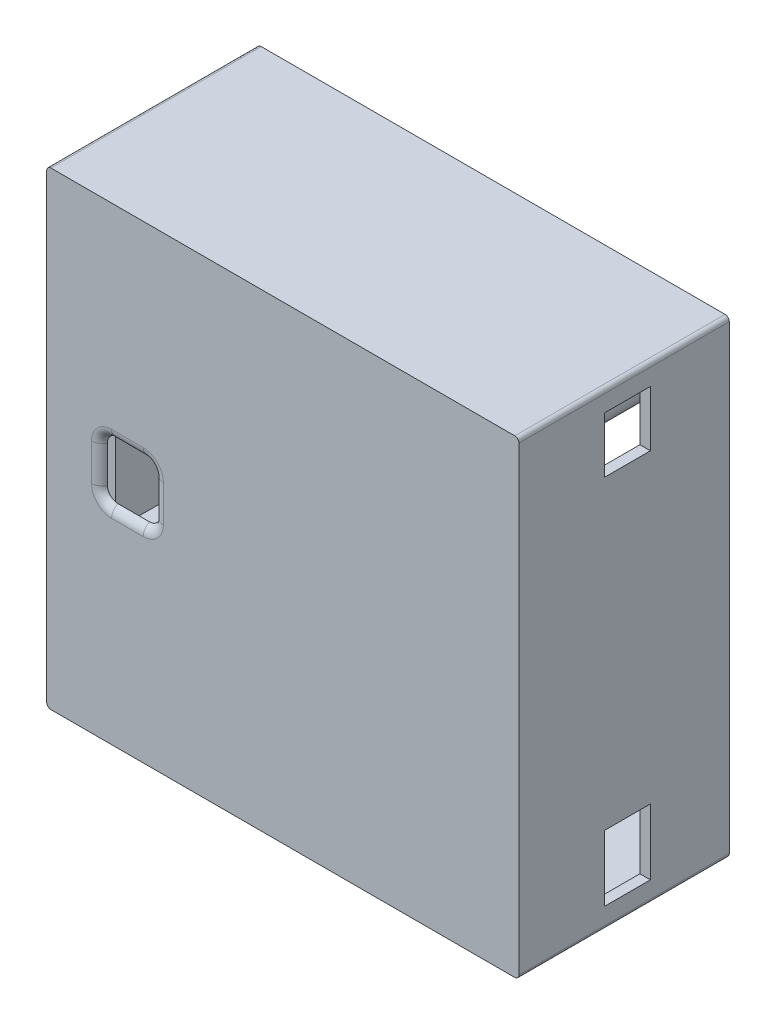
ISO-10303-21;
HEADER;
FILE_DESCRIPTION(('STEP AP214'),'2;1');
FILE_NAME('part.step','',(''),(''),'','','');
FILE_SCHEMA(('AUTOMOTIVE_DESIGN { 1 0 10303 214 1 1 1 1 }'));
ENDSEC;
DATA;
#1=APPLICATION_CONTEXT('core data for automotive mechanical design processes');
#2=APPLICATION_PROTOCOL_DEFINITION('international standard','automotive_design',2000,#1);
#3=PRODUCT_CONTEXT('',#1,'mechanical');
#4=PRODUCT('Part','Part','',(#3));
#5=PRODUCT_RELATED_PRODUCT_CATEGORY('part','',(#4));
#6=PRODUCT_DEFINITION_FORMATION('','',#4);
#7=PRODUCT_DEFINITION_CONTEXT('part definition',#1,'design');
#8=PRODUCT_DEFINITION('design','',#6,#7);
#9=PRODUCT_DEFINITION_SHAPE('','',#8);
#10=(LENGTH_UNIT() NAMED_UNIT(*) SI_UNIT(.MILLI.,.METRE.));
#11=(NAMED_UNIT(*) PLANE_ANGLE_UNIT() SI_UNIT($,.RADIAN.));
#12=(NAMED_UNIT(*) SI_UNIT($,.STERADIAN.) SOLID_ANGLE_UNIT());
#13=UNCERTAINTY_MEASURE_WITH_UNIT(LENGTH_MEASURE(1.E-05),#10,'distance_accuracy_value','');
#14=(GEOMETRIC_REPRESENTATION_CONTEXT(3) GLOBAL_UNCERTAINTY_ASSIGNED_CONTEXT((#13)) GLOBAL_UNIT_ASSIGNED_CONTEXT((#10,
#11,#12)) REPRESENTATION_CONTEXT('',''));
#15=CARTESIAN_POINT('',(0.,0.,0.));
#16=DIRECTION('',(0.,0.,1.));
#17=DIRECTION('',(1.,0.,0.));
#18=AXIS2_PLACEMENT_3D('',#15,#16,#17);
#19=CARTESIAN_POINT('',(0.,0.,38.8));
#20=DIRECTION('',(0.,0.,1.));
#21=DIRECTION('',(1.,0.,0.));
#22=AXIS2_PLACEMENT_3D('',#19,#20,#21);
#23=PLANE('',#22);
#24=DIRECTION('',(-1.,0.,0.));
#25=VECTOR('',#24,1.);
#26=CARTESIAN_POINT('',(-32.5532663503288,5.50000000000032,38.8));
#27=LINE('',#26,#25);
#28=CARTESIAN_POINT('',(-26.5532663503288,5.50000000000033,38.8));
#29=VERTEX_POINT('',#28);
#30=CARTESIAN_POINT('',(-32.5532663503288,5.50000000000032,38.8));
#31=VERTEX_POINT('',#30);
#32=EDGE_CURVE('E500',#29,#31,#27,.T.);
#33=ORIENTED_EDGE('',*,*,#32,.T.);
#34=CARTESIAN_POINT('',(-32.5532663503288,3.50000000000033,38.8));
#35=DIRECTION('',(0.,0.,1.));
#36=DIRECTION('',(-1.,0.,0.));
#37=AXIS2_PLACEMENT_3D('',#34,#35,#36);
#38=CIRCLE('',#37,2.);
#39=CARTESIAN_POINT('',(-33.0326092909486,5.44170809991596,38.8));
#40=VERTEX_POINT('',#39);
#41=EDGE_CURVE('E297',#31,#40,#38,.T.);
#42=ORIENTED_EDGE('',*,*,#41,.T.);
#43=DIRECTION('',(0.,1.,0.));
#44=VECTOR('',#43,1.);
#45=CARTESIAN_POINT('',(-33.0326092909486,0.,38.8));
#46=LINE('',#45,#44);
#47=CARTESIAN_POINT('',(-33.0326092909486,10.0000000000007,38.8));
#48=VERTEX_POINT('',#47);
#49=EDGE_CURVE('E544',#40,#48,#46,.T.);
#50=ORIENTED_EDGE('',*,*,#49,.T.);
#51=DIRECTION('',(-1.,0.,0.));
#52=VECTOR('',#51,1.);
#53=CARTESIAN_POINT('',(0.,10.0000000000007,38.8));
#54=LINE('',#53,#52);
#55=CARTESIAN_POINT('',(-28.0326092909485,10.0000000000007,38.8));
#56=VERTEX_POINT('',#55);
#57=EDGE_CURVE('E540',#56,#48,#54,.T.);
#58=ORIENTED_EDGE('',*,*,#57,.F.);
#59=DIRECTION('',(0.,1.,0.));
#60=VECTOR('',#59,1.);
#61=CARTESIAN_POINT('',(-28.0326092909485,0.,38.8));
#62=LINE('',#61,#60);
#63=CARTESIAN_POINT('',(-28.0326092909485,12.,38.8));
#64=VERTEX_POINT('',#63);
#65=EDGE_CURVE('E520',#56,#64,#62,.T.);
#66=ORIENTED_EDGE('',*,*,#65,.T.);
#67=DIRECTION('',(-1.,0.,0.));
#68=VECTOR('',#67,1.);
#69=CARTESIAN_POINT('',(0.,12.,38.8));
#70=LINE('',#69,#68);
#71=CARTESIAN_POINT('',(-35.0326092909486,12.,38.8));
#72=VERTEX_POINT('',#71);
#73=EDGE_CURVE('E528',#64,#72,#70,.T.);
#74=ORIENTED_EDGE('',*,*,#73,.T.);
#75=DIRECTION('',(0.,1.,0.));
#76=VECTOR('',#75,1.);
#77=CARTESIAN_POINT('',(-35.0326092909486,0.,38.8));
#78=LINE('',#77,#76);
#79=CARTESIAN_POINT('',(-35.0326092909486,-12.,38.8));
#80=VERTEX_POINT('',#79);
#81=EDGE_CURVE('E559',#80,#72,#78,.T.);
#82=ORIENTED_EDGE('',*,*,#81,.F.);
#83=DIRECTION('',(-1.,0.,0.));
#84=VECTOR('',#83,1.);
#85=CARTESIAN_POINT('',(0.,-12.,38.8));
#86=LINE('',#85,#84);
#87=CARTESIAN_POINT('',(-28.0326092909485,-12.,38.8));
#88=VERTEX_POINT('',#87);
#89=EDGE_CURVE('E556',#88,#80,#86,.T.);
#90=ORIENTED_EDGE('',*,*,#89,.F.);
#91=DIRECTION('',(0.,-1.,0.));
#92=VECTOR('',#91,1.);
#93=CARTESIAN_POINT('',(-28.0326092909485,0.,38.8));
#94=LINE('',#93,#92);
#95=CARTESIAN_POINT('',(-28.0326092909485,-10.,38.8));
#96=VERTEX_POINT('',#95);
#97=EDGE_CURVE('E553',#96,#88,#94,.T.);
#98=ORIENTED_EDGE('',*,*,#97,.F.);
#99=DIRECTION('',(-1.,0.,0.));
#100=VECTOR('',#99,1.);
#101=CARTESIAN_POINT('',(0.,-10.,38.8));
#102=LINE('',#101,#100);
#103=CARTESIAN_POINT('',(-33.0326092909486,-10.,38.8));
#104=VERTEX_POINT('',#103);
#105=EDGE_CURVE('E549',#96,#104,#102,.T.);
#106=ORIENTED_EDGE('',*,*,#105,.T.);
#107=CARTESIAN_POINT('',(-33.0326092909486,-5.44170809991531,38.8));
#108=VERTEX_POINT('',#107);
#109=EDGE_CURVE('E545',#104,#108,#46,.T.);
#110=ORIENTED_EDGE('',*,*,#109,.T.);
#111=CARTESIAN_POINT('',(-32.5532663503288,-3.49999999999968,38.8));
#112=DIRECTION('',(0.,0.,1.));
#113=DIRECTION('',(1.,0.,0.));
#114=AXIS2_PLACEMENT_3D('',#111,#112,#113);
#115=CIRCLE('',#114,2.);
#116=CARTESIAN_POINT('',(-32.5532663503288,-5.49999999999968,38.8));
#117=VERTEX_POINT('',#116);
#118=EDGE_CURVE('E309',#108,#117,#115,.T.);
#119=ORIENTED_EDGE('',*,*,#118,.T.);
#120=DIRECTION('',(1.,0.,0.));
#121=VECTOR('',#120,1.);
#122=CARTESIAN_POINT('',(-32.5532663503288,-5.49999999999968,38.8));
#123=LINE('',#122,#121);
#124=CARTESIAN_POINT('',(-26.5532663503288,-5.49999999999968,38.8));
#125=VERTEX_POINT('',#124);
#126=EDGE_CURVE('E485',#117,#125,#123,.T.);
#127=ORIENTED_EDGE('',*,*,#126,.T.);
#128=CARTESIAN_POINT('',(-26.5532663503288,-3.49999999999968,38.8));
#129=DIRECTION('',(0.,0.,1.));
#130=DIRECTION('',(1.,0.,0.));
#131=AXIS2_PLACEMENT_3D('',#128,#129,#130);
#132=CIRCLE('',#131,2.);
#133=CARTESIAN_POINT('',(-24.5532663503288,-3.49999999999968,38.8));
#134=VERTEX_POINT('',#133);
#135=EDGE_CURVE('E489',#125,#134,#132,.T.);
#136=ORIENTED_EDGE('',*,*,#135,.T.);
#137=DIRECTION('',(0.,1.,0.));
#138=VECTOR('',#137,1.);
#139=CARTESIAN_POINT('',(-24.5532663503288,-3.49999999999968,38.8));
#140=LINE('',#139,#138);
#141=CARTESIAN_POINT('',(-24.5532663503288,3.50000000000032,38.8));
#142=VERTEX_POINT('',#141);
#143=EDGE_CURVE('E494',#134,#142,#140,.T.);
#144=ORIENTED_EDGE('',*,*,#143,.T.);
#145=CARTESIAN_POINT('',(-26.5532663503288,3.50000000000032,38.8));
#146=DIRECTION('',(0.,0.,1.));
#147=DIRECTION('',(-1.,0.,0.));
#148=AXIS2_PLACEMENT_3D('',#145,#146,#147);
#149=CIRCLE('',#148,2.);
#150=EDGE_CURVE('E497',#142,#29,#149,.T.);
#151=ORIENTED_EDGE('',*,*,#150,.T.);
#152=EDGE_LOOP('',(#33,#42,#50,#58,#66,#74,#82,#90,#98,#106,#110,#119,#127,#136,#144,#151));
#153=FACE_BOUND('',#152,.T.);
#154=CARTESIAN_POINT('',(26.2,-34.8,38.8));
#155=DIRECTION('',(0.,0.,1.));
#156=DIRECTION('',(1.,0.,0.));
#157=AXIS2_PLACEMENT_3D('',#154,#155,#156);
#158=CIRCLE('',#157,3.9);
#159=CARTESIAN_POINT('',(30.1,-34.8,38.8));
#160=VERTEX_POINT('',#159);
#161=EDGE_CURVE('E448',#160,#160,#158,.F.);
#162=ORIENTED_EDGE('',*,*,#161,.F.);
#163=EDGE_LOOP('',(#162));
#164=FACE_BOUND('',#163,.T.);
#165=CARTESIAN_POINT('',(-35.5,-35.3,38.8));
#166=DIRECTION('',(0.,0.,1.));
#167=DIRECTION('',(1.,0.,0.));
#168=AXIS2_PLACEMENT_3D('',#165,#166,#167);
#169=CIRCLE('',#168,3.9);
#170=CARTESIAN_POINT('',(-31.6,-35.3,38.8));
#171=VERTEX_POINT('',#170);
#172=EDGE_CURVE('E444',#171,#171,#169,.F.);
#173=ORIENTED_EDGE('',*,*,#172,.F.);
#174=EDGE_LOOP('',(#173));
#175=FACE_BOUND('',#174,.T.);
#176=CARTESIAN_POINT('',(-35.8,35.4,38.8));
#177=DIRECTION('',(0.,0.,1.));
#178=DIRECTION('',(1.,0.,0.));
#179=AXIS2_PLACEMENT_3D('',#176,#177,#178);
#180=CIRCLE('',#179,3.9);
#181=CARTESIAN_POINT('',(-31.9,35.4,38.8));
#182=VERTEX_POINT('',#181);
#183=EDGE_CURVE('E440',#182,#182,#180,.F.);
#184=ORIENTED_EDGE('',*,*,#183,.F.);
#185=EDGE_LOOP('',(#184));
#186=FACE_BOUND('',#185,.T.);
#187=CARTESIAN_POINT('',(36.,35.6,38.8));
#188=DIRECTION('',(0.,0.,1.));
#189=DIRECTION('',(1.,0.,0.));
#190=AXIS2_PLACEMENT_3D('',#187,#188,#189);
#191=CIRCLE('',#190,3.9);
#192=CARTESIAN_POINT('',(39.9,35.6,38.8));
#193=VERTEX_POINT('',#192);
#194=EDGE_CURVE('E435',#193,#193,#191,.F.);
#195=ORIENTED_EDGE('',*,*,#194,.F.);
#196=EDGE_LOOP('',(#195));
#197=FACE_BOUND('',#196,.T.);
#198=DIRECTION('',(1.,0.,0.));
#199=VECTOR('',#198,1.);
#200=CARTESIAN_POINT('',(42.9,42.6,38.8));
#201=LINE('',#200,#199);
#202=CARTESIAN_POINT('',(-42.9,42.6,38.8));
#203=VERTEX_POINT('',#202);
#204=CARTESIAN_POINT('',(42.9,42.6,38.8));
#205=VERTEX_POINT('',#204);
#206=EDGE_CURVE('E677',#203,#205,#201,.T.);
#207=ORIENTED_EDGE('',*,*,#206,.T.);
#208=DIRECTION('',(0.,-1.,0.));
#209=VECTOR('',#208,1.);
#210=CARTESIAN_POINT('',(42.9,42.6,38.8));
#211=LINE('',#210,#209);
#212=CARTESIAN_POINT('',(42.9,-42.6,38.8));
#213=VERTEX_POINT('',#212);
#214=EDGE_CURVE('E685',#205,#213,#211,.T.);
#215=ORIENTED_EDGE('',*,*,#214,.T.);
#216=DIRECTION('',(-1.,0.,0.));
#217=VECTOR('',#216,1.);
#218=CARTESIAN_POINT('',(42.9,-42.6,38.8));
#219=LINE('',#218,#217);
#220=CARTESIAN_POINT('',(-42.9,-42.6,38.8));
#221=VERTEX_POINT('',#220);
#222=EDGE_CURVE('E681',#213,#221,#219,.T.);
#223=ORIENTED_EDGE('',*,*,#222,.T.);
#224=DIRECTION('',(0.,1.,0.));
#225=VECTOR('',#224,1.);
#226=CARTESIAN_POINT('',(-42.9,42.6,38.8));
#227=LINE('',#226,#225);
#228=EDGE_CURVE('E431',#221,#203,#227,.T.);
#229=ORIENTED_EDGE('',*,*,#228,.T.);
#230=EDGE_LOOP('',(#207,#215,#223,#229));
#231=FACE_BOUND('',#230,.T.);
#232=ADVANCED_FACE('F44',(#153,#164,#175,#186,#197,#231),#23,.F.);
#233=CARTESIAN_POINT('',(42.9,42.6,-105.916003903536));
#234=DIRECTION('',(1.,0.,0.));
#235=DIRECTION('',(0.,0.,-1.));
#236=AXIS2_PLACEMENT_3D('',#233,#234,#235);
#237=PLANE('',#236);
#238=DIRECTION('',(0.,0.,1.));
#239=VECTOR('',#238,1.);
#240=CARTESIAN_POINT('',(42.9,42.6,-105.916003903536));
#241=LINE('',#240,#239);
#242=CARTESIAN_POINT('',(42.9,42.6,0.));
#243=VERTEX_POINT('',#242);
#244=EDGE_CURVE('E753',#243,#205,#241,.T.);
#245=ORIENTED_EDGE('',*,*,#244,.F.);
#246=DIRECTION('',(0.,-1.,0.));
#247=VECTOR('',#246,1.);
#248=CARTESIAN_POINT('',(42.9,42.6,0.));
#249=LINE('',#248,#247);
#250=CARTESIAN_POINT('',(42.9,-42.6,0.));
#251=VERTEX_POINT('',#250);
#252=EDGE_CURVE('E656',#243,#251,#249,.T.);
#253=ORIENTED_EDGE('',*,*,#252,.T.);
#254=DIRECTION('',(0.,0.,1.));
#255=VECTOR('',#254,1.);
#256=CARTESIAN_POINT('',(42.9,-42.6,-105.916003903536));
#257=LINE('',#256,#255);
#258=EDGE_CURVE('E425',#251,#213,#257,.T.);
#259=ORIENTED_EDGE('',*,*,#258,.T.);
#260=ORIENTED_EDGE('',*,*,#214,.F.);
#261=EDGE_LOOP('',(#245,#253,#259,#260));
#262=FACE_BOUND('',#261,.T.);
#263=DIRECTION('',(0.,0.,1.));
#264=VECTOR('',#263,1.);
#265=CARTESIAN_POINT('',(42.9,-28.13,40.001));
#266=LINE('',#265,#264);
#267=CARTESIAN_POINT('',(42.9,-28.13,15.));
#268=VERTEX_POINT('',#267);
#269=CARTESIAN_POINT('',(42.9,-28.13,23.7));
#270=VERTEX_POINT('',#269);
#271=EDGE_CURVE('E638',#268,#270,#266,.T.);
#272=ORIENTED_EDGE('',*,*,#271,.T.);
#273=DIRECTION('',(0.,-1.,0.));
#274=VECTOR('',#273,1.);
#275=CARTESIAN_POINT('',(42.9,42.6,23.7));
#276=LINE('',#275,#274);
#277=CARTESIAN_POINT('',(42.9,-40.63,23.7));
#278=VERTEX_POINT('',#277);
#279=EDGE_CURVE('E641',#270,#278,#276,.T.);
#280=ORIENTED_EDGE('',*,*,#279,.T.);
#281=DIRECTION('',(0.,0.,-1.));
#282=VECTOR('',#281,1.);
#283=CARTESIAN_POINT('',(42.9,-40.63,40.001));
#284=LINE('',#283,#282);
#285=CARTESIAN_POINT('',(42.9,-40.63,15.));
#286=VERTEX_POINT('',#285);
#287=EDGE_CURVE('E644',#278,#286,#284,.T.);
#288=ORIENTED_EDGE('',*,*,#287,.T.);
#289=DIRECTION('',(0.,-1.,0.));
#290=VECTOR('',#289,1.);
#291=CARTESIAN_POINT('',(42.9,42.6,15.));
#292=LINE('',#291,#290);
#293=EDGE_CURVE('E661',#268,#286,#292,.T.);
#294=ORIENTED_EDGE('',*,*,#293,.F.);
#295=EDGE_LOOP('',(#272,#280,#288,#294));
#296=FACE_BOUND('',#295,.T.);
#297=DIRECTION('',(0.,0.,1.));
#298=VECTOR('',#297,1.);
#299=CARTESIAN_POINT('',(42.9,40.63,40.001));
#300=LINE('',#299,#298);
#301=CARTESIAN_POINT('',(42.9,40.63,15.));
#302=VERTEX_POINT('',#301);
#303=CARTESIAN_POINT('',(42.9,40.63,23.7));
#304=VERTEX_POINT('',#303);
#305=EDGE_CURVE('E647',#302,#304,#300,.T.);
#306=ORIENTED_EDGE('',*,*,#305,.T.);
#307=DIRECTION('',(0.,-1.,0.));
#308=VECTOR('',#307,1.);
#309=CARTESIAN_POINT('',(42.9,42.6,23.7));
#310=LINE('',#309,#308);
#311=CARTESIAN_POINT('',(42.9,30.03,23.7));
#312=VERTEX_POINT('',#311);
#313=EDGE_CURVE('E650',#304,#312,#310,.T.);
#314=ORIENTED_EDGE('',*,*,#313,.T.);
#315=DIRECTION('',(0.,0.,-1.));
#316=VECTOR('',#315,1.);
#317=CARTESIAN_POINT('',(42.9,30.03,40.001));
#318=LINE('',#317,#316);
#319=CARTESIAN_POINT('',(42.9,30.03,15.));
#320=VERTEX_POINT('',#319);
#321=EDGE_CURVE('E653',#312,#320,#318,.T.);
#322=ORIENTED_EDGE('',*,*,#321,.T.);
#323=EDGE_CURVE('E676',#302,#320,#292,.T.);
#324=ORIENTED_EDGE('',*,*,#323,.F.);
#325=EDGE_LOOP('',(#306,#314,#322,#324));
#326=FACE_BOUND('',#325,.T.);
#327=ADVANCED_FACE('F797',(#262,#296,#326),#237,.F.);
#328=CARTESIAN_POINT('',(42.9,-42.6,-105.916003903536));
#329=DIRECTION('',(0.,-1.,0.));
#330=DIRECTION('',(1.,0.,0.));
#331=AXIS2_PLACEMENT_3D('',#328,#329,#330);
#332=PLANE('',#331);
#333=DIRECTION('',(-1.,0.,0.));
#334=VECTOR('',#333,1.);
#335=CARTESIAN_POINT('',(42.9,-42.6,0.));
#336=LINE('',#335,#334);
#337=CARTESIAN_POINT('',(-42.9,-42.6,0.));
#338=VERTEX_POINT('',#337);
#339=EDGE_CURVE('E666',#251,#338,#336,.T.);
#340=ORIENTED_EDGE('',*,*,#339,.T.);
#341=DIRECTION('',(0.,0.,1.));
#342=VECTOR('',#341,1.);
#343=CARTESIAN_POINT('',(-42.9,-42.6,-105.916003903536));
#344=LINE('',#343,#342);
#345=EDGE_CURVE('E757',#338,#221,#344,.T.);
#346=ORIENTED_EDGE('',*,*,#345,.T.);
#347=ORIENTED_EDGE('',*,*,#222,.F.);
#348=ORIENTED_EDGE('',*,*,#258,.F.);
#349=EDGE_LOOP('',(#340,#346,#347,#348));
#350=FACE_BOUND('',#349,.T.);
#351=ADVANCED_FACE('F803',(#350),#332,.F.);
#352=CARTESIAN_POINT('',(42.9,42.6,-105.916003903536));
#353=DIRECTION('',(0.,1.,0.));
#354=DIRECTION('',(0.,0.,1.));
#355=AXIS2_PLACEMENT_3D('',#352,#353,#354);
#356=PLANE('',#355);
#357=DIRECTION('',(0.,0.,1.));
#358=VECTOR('',#357,1.);
#359=CARTESIAN_POINT('',(-42.9,42.6,-105.916003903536));
#360=LINE('',#359,#358);
#361=CARTESIAN_POINT('',(-42.9,42.6,0.));
#362=VERTEX_POINT('',#361);
#363=EDGE_CURVE('E761',#362,#203,#360,.T.);
#364=ORIENTED_EDGE('',*,*,#363,.F.);
#365=DIRECTION('',(1.,0.,0.));
#366=VECTOR('',#365,1.);
#367=CARTESIAN_POINT('',(42.9,42.6,0.));
#368=LINE('',#367,#366);
#369=EDGE_CURVE('E657',#362,#243,#368,.T.);
#370=ORIENTED_EDGE('',*,*,#369,.T.);
#371=ORIENTED_EDGE('',*,*,#244,.T.);
#372=ORIENTED_EDGE('',*,*,#206,.F.);
#373=EDGE_LOOP('',(#364,#370,#371,#372));
#374=FACE_BOUND('',#373,.T.);
#375=ADVANCED_FACE('F837',(#374),#356,.F.);
#376=CARTESIAN_POINT('',(-42.9,42.6,-105.916003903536));
#377=DIRECTION('',(-1.,0.,0.));
#378=DIRECTION('',(0.,0.,1.));
#379=AXIS2_PLACEMENT_3D('',#376,#377,#378);
#380=PLANE('',#379);
#381=ORIENTED_EDGE('',*,*,#228,.F.);
#382=ORIENTED_EDGE('',*,*,#345,.F.);
#383=DIRECTION('',(0.,1.,0.));
#384=VECTOR('',#383,1.);
#385=CARTESIAN_POINT('',(-42.9,42.6,0.));
#386=LINE('',#385,#384);
#387=EDGE_CURVE('E662',#338,#362,#386,.T.);
#388=ORIENTED_EDGE('',*,*,#387,.T.);
#389=ORIENTED_EDGE('',*,*,#363,.T.);
#390=EDGE_LOOP('',(#381,#382,#388,#389));
#391=FACE_BOUND('',#390,.T.);
#392=ADVANCED_FACE('F839',(#391),#380,.F.);
#393=CARTESIAN_POINT('',(0.,0.,15.));
#394=DIRECTION('',(0.,0.,1.));
#395=DIRECTION('',(1.,0.,0.));
#396=AXIS2_PLACEMENT_3D('',#393,#394,#395);
#397=PLANE('',#396);
#398=ORIENTED_EDGE('',*,*,#293,.T.);
#399=DIRECTION('',(-1.,0.,0.));
#400=VECTOR('',#399,1.);
#401=CARTESIAN_POINT('',(48.9,-40.63,15.));
#402=LINE('',#401,#400);
#403=CARTESIAN_POINT('',(44.9,-40.63,15.));
#404=VERTEX_POINT('',#403);
#405=EDGE_CURVE('E707',#404,#286,#402,.T.);
#406=ORIENTED_EDGE('',*,*,#405,.F.);
#407=DIRECTION('',(0.,-1.,0.));
#408=VECTOR('',#407,1.);
#409=CARTESIAN_POINT('',(44.9,-44.6,15.));
#410=LINE('',#409,#408);
#411=CARTESIAN_POINT('',(44.9,-28.13,15.));
#412=VERTEX_POINT('',#411);
#413=EDGE_CURVE('E733',#412,#404,#410,.T.);
#414=ORIENTED_EDGE('',*,*,#413,.F.);
#415=DIRECTION('',(-1.,0.,0.));
#416=VECTOR('',#415,1.);
#417=CARTESIAN_POINT('',(48.9,-28.13,15.));
#418=LINE('',#417,#416);
#419=EDGE_CURVE('E689',#412,#268,#418,.T.);
#420=ORIENTED_EDGE('',*,*,#419,.T.);
#421=EDGE_LOOP('',(#398,#406,#414,#420));
#422=FACE_BOUND('',#421,.T.);
#423=ADVANCED_FACE('F842',(#422),#397,.T.);
#424=ORIENTED_EDGE('',*,*,#323,.T.);
#425=DIRECTION('',(-1.,0.,0.));
#426=VECTOR('',#425,1.);
#427=CARTESIAN_POINT('',(48.9,30.03,15.));
#428=LINE('',#427,#426);
#429=CARTESIAN_POINT('',(44.9,30.03,15.));
#430=VERTEX_POINT('',#429);
#431=EDGE_CURVE('E703',#430,#320,#428,.T.);
#432=ORIENTED_EDGE('',*,*,#431,.F.);
#433=DIRECTION('',(0.,-1.,0.));
#434=VECTOR('',#433,1.);
#435=CARTESIAN_POINT('',(44.9,-44.6,15.));
#436=LINE('',#435,#434);
#437=CARTESIAN_POINT('',(44.9,40.63,15.));
#438=VERTEX_POINT('',#437);
#439=EDGE_CURVE('E749',#438,#430,#436,.T.);
#440=ORIENTED_EDGE('',*,*,#439,.F.);
#441=DIRECTION('',(-1.,0.,0.));
#442=VECTOR('',#441,1.);
#443=CARTESIAN_POINT('',(48.9,40.63,15.));
#444=LINE('',#443,#442);
#445=EDGE_CURVE('E690',#438,#302,#444,.T.);
#446=ORIENTED_EDGE('',*,*,#445,.T.);
#447=EDGE_LOOP('',(#424,#432,#440,#446));
#448=FACE_BOUND('',#447,.T.);
#449=ADVANCED_FACE('F849',(#448),#397,.T.);
#450=CARTESIAN_POINT('',(0.,0.,40.));
#451=DIRECTION('',(0.,0.,1.));
#452=DIRECTION('',(1.,0.,0.));
#453=AXIS2_PLACEMENT_3D('',#450,#451,#452);
#454=PLANE('',#453);
#455=DIRECTION('',(0.,1.,0.));
#456=VECTOR('',#455,1.);
#457=CARTESIAN_POINT('',(-36.3862966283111,3.50000000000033,40.));
#458=LINE('',#457,#456);
#459=CARTESIAN_POINT('',(-36.3862966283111,-3.49999999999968,40.));
#460=VERTEX_POINT('',#459);
#461=CARTESIAN_POINT('',(-36.3862966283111,3.50000000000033,40.));
#462=VERTEX_POINT('',#461);
#463=EDGE_CURVE('E453',#460,#462,#458,.T.);
#464=ORIENTED_EDGE('',*,*,#463,.T.);
#465=CARTESIAN_POINT('',(-32.5532663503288,3.50000000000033,40.));
#466=DIRECTION('',(0.,0.,1.));
#467=DIRECTION('',(1.,0.,0.));
#468=AXIS2_PLACEMENT_3D('',#465,#466,#467);
#469=CIRCLE('',#468,3.83303027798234);
#470=CARTESIAN_POINT('',(-32.5532663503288,7.33303027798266,40.));
#471=VERTEX_POINT('',#470);
#472=EDGE_CURVE('E314',#462,#471,#469,.F.);
#473=ORIENTED_EDGE('',*,*,#472,.T.);
#474=DIRECTION('',(-1.,0.,0.));
#475=VECTOR('',#474,1.);
#476=CARTESIAN_POINT('',(-26.5532663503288,7.33303027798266,40.));
#477=LINE('',#476,#475);
#478=CARTESIAN_POINT('',(-26.5532663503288,7.33303027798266,40.));
#479=VERTEX_POINT('',#478);
#480=EDGE_CURVE('E471',#471,#479,#477,.F.);
#481=ORIENTED_EDGE('',*,*,#480,.T.);
#482=CARTESIAN_POINT('',(-26.5532663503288,3.50000000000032,40.));
#483=DIRECTION('',(0.,0.,1.));
#484=DIRECTION('',(1.,0.,0.));
#485=AXIS2_PLACEMENT_3D('',#482,#483,#484);
#486=CIRCLE('',#485,3.83303027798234);
#487=CARTESIAN_POINT('',(-22.7202360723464,3.50000000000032,40.));
#488=VERTEX_POINT('',#487);
#489=EDGE_CURVE('E469',#479,#488,#486,.F.);
#490=ORIENTED_EDGE('',*,*,#489,.T.);
#491=DIRECTION('',(0.,1.,0.));
#492=VECTOR('',#491,1.);
#493=CARTESIAN_POINT('',(-22.7202360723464,-3.49999999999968,40.));
#494=LINE('',#493,#492);
#495=CARTESIAN_POINT('',(-22.7202360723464,-3.49999999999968,40.));
#496=VERTEX_POINT('',#495);
#497=EDGE_CURVE('E466',#488,#496,#494,.F.);
#498=ORIENTED_EDGE('',*,*,#497,.T.);
#499=CARTESIAN_POINT('',(-26.5532663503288,-3.49999999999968,40.));
#500=DIRECTION('',(0.,0.,1.));
#501=DIRECTION('',(1.,0.,0.));
#502=AXIS2_PLACEMENT_3D('',#499,#500,#501);
#503=CIRCLE('',#502,3.83303027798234);
#504=CARTESIAN_POINT('',(-26.5532663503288,-7.33303027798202,40.));
#505=VERTEX_POINT('',#504);
#506=EDGE_CURVE('E463',#496,#505,#503,.F.);
#507=ORIENTED_EDGE('',*,*,#506,.T.);
#508=DIRECTION('',(1.,0.,0.));
#509=VECTOR('',#508,1.);
#510=CARTESIAN_POINT('',(-32.5532663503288,-7.33303027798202,40.));
#511=LINE('',#510,#509);
#512=CARTESIAN_POINT('',(-32.5532663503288,-7.33303027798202,40.));
#513=VERTEX_POINT('',#512);
#514=EDGE_CURVE('E460',#505,#513,#511,.F.);
#515=ORIENTED_EDGE('',*,*,#514,.T.);
#516=CARTESIAN_POINT('',(-32.5532663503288,-3.49999999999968,40.));
#517=DIRECTION('',(0.,0.,1.));
#518=DIRECTION('',(1.,0.,0.));
#519=AXIS2_PLACEMENT_3D('',#516,#517,#518);
#520=CIRCLE('',#519,3.83303027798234);
#521=EDGE_CURVE('E456',#513,#460,#520,.F.);
#522=ORIENTED_EDGE('',*,*,#521,.T.);
#523=EDGE_LOOP('',(#464,#473,#481,#490,#498,#507,#515,#522));
#524=FACE_BOUND('',#523,.T.);
#525=DIRECTION('',(0.,1.,0.));
#526=VECTOR('',#525,1.);
#527=CARTESIAN_POINT('',(44.9,-44.6,40.));
#528=LINE('',#527,#526);
#529=CARTESIAN_POINT('',(44.9,-43.8,40.));
#530=VERTEX_POINT('',#529);
#531=CARTESIAN_POINT('',(44.9,43.8,40.));
#532=VERTEX_POINT('',#531);
#533=EDGE_CURVE('E404',#530,#532,#528,.T.);
#534=ORIENTED_EDGE('',*,*,#533,.T.);
#535=CARTESIAN_POINT('',(44.1,43.8,40.));
#536=DIRECTION('',(0.,0.,1.));
#537=DIRECTION('',(1.,0.,0.));
#538=AXIS2_PLACEMENT_3D('',#535,#536,#537);
#539=CIRCLE('',#538,0.8);
#540=CARTESIAN_POINT('',(44.1,44.6,40.));
#541=VERTEX_POINT('',#540);
#542=EDGE_CURVE('E378',#532,#541,#539,.T.);
#543=ORIENTED_EDGE('',*,*,#542,.T.);
#544=DIRECTION('',(-1.,0.,0.));
#545=VECTOR('',#544,1.);
#546=CARTESIAN_POINT('',(-44.9,44.6,40.));
#547=LINE('',#546,#545);
#548=CARTESIAN_POINT('',(-44.1,44.6,40.));
#549=VERTEX_POINT('',#548);
#550=EDGE_CURVE('E769',#541,#549,#547,.T.);
#551=ORIENTED_EDGE('',*,*,#550,.T.);
#552=CARTESIAN_POINT('',(-44.1,43.8,40.));
#553=DIRECTION('',(0.,0.,1.));
#554=DIRECTION('',(1.,0.,0.));
#555=AXIS2_PLACEMENT_3D('',#552,#553,#554);
#556=CIRCLE('',#555,0.8);
#557=CARTESIAN_POINT('',(-44.9,43.8,40.));
#558=VERTEX_POINT('',#557);
#559=EDGE_CURVE('E67',#549,#558,#556,.T.);
#560=ORIENTED_EDGE('',*,*,#559,.T.);
#561=DIRECTION('',(0.,-1.,0.));
#562=VECTOR('',#561,1.);
#563=CARTESIAN_POINT('',(-44.9,-44.6,40.));
#564=LINE('',#563,#562);
#565=CARTESIAN_POINT('',(-44.9,-43.8,40.));
#566=VERTEX_POINT('',#565);
#567=EDGE_CURVE('E436',#558,#566,#564,.T.);
#568=ORIENTED_EDGE('',*,*,#567,.T.);
#569=CARTESIAN_POINT('',(-44.1,-43.8,40.));
#570=DIRECTION('',(0.,0.,1.));
#571=DIRECTION('',(1.,0.,0.));
#572=AXIS2_PLACEMENT_3D('',#569,#570,#571);
#573=CIRCLE('',#572,0.8);
#574=CARTESIAN_POINT('',(-44.1,-44.6,40.));
#575=VERTEX_POINT('',#574);
#576=EDGE_CURVE('E373',#566,#575,#573,.T.);
#577=ORIENTED_EDGE('',*,*,#576,.T.);
#578=DIRECTION('',(1.,0.,0.));
#579=VECTOR('',#578,1.);
#580=CARTESIAN_POINT('',(-44.9,-44.6,40.));
#581=LINE('',#580,#579);
#582=CARTESIAN_POINT('',(44.1,-44.6,40.));
#583=VERTEX_POINT('',#582);
#584=EDGE_CURVE('E393',#575,#583,#581,.T.);
#585=ORIENTED_EDGE('',*,*,#584,.T.);
#586=CARTESIAN_POINT('',(44.1,-43.8,40.));
#587=DIRECTION('',(0.,0.,1.));
#588=DIRECTION('',(1.,0.,0.));
#589=AXIS2_PLACEMENT_3D('',#586,#587,#588);
#590=CIRCLE('',#589,0.8);
#591=EDGE_CURVE('E370',#583,#530,#590,.T.);
#592=ORIENTED_EDGE('',*,*,#591,.T.);
#593=EDGE_LOOP('',(#534,#543,#551,#560,#568,#577,#585,#592));
#594=FACE_BOUND('',#593,.T.);
#595=ADVANCED_FACE('F400',(#524,#594),#454,.T.);
#596=CARTESIAN_POINT('',(0.,0.,0.));
#597=DIRECTION('',(0.,0.,1.));
#598=DIRECTION('',(1.,0.,0.));
#599=AXIS2_PLACEMENT_3D('',#596,#597,#598);
#600=PLANE('',#599);
#601=ORIENTED_EDGE('',*,*,#387,.F.);
#602=ORIENTED_EDGE('',*,*,#339,.F.);
#603=ORIENTED_EDGE('',*,*,#252,.F.);
#604=ORIENTED_EDGE('',*,*,#369,.F.);
#605=EDGE_LOOP('',(#601,#602,#603,#604));
#606=FACE_BOUND('',#605,.T.);
#607=DIRECTION('',(-1.,0.,0.));
#608=VECTOR('',#607,1.);
#609=CARTESIAN_POINT('',(-44.9,44.6,0.));
#610=LINE('',#609,#608);
#611=CARTESIAN_POINT('',(44.1,44.6,0.));
#612=VERTEX_POINT('',#611);
#613=CARTESIAN_POINT('',(-44.1,44.6,0.));
#614=VERTEX_POINT('',#613);
#615=EDGE_CURVE('E419',#612,#614,#610,.T.);
#616=ORIENTED_EDGE('',*,*,#615,.F.);
#617=CARTESIAN_POINT('',(44.1,43.8,0.));
#618=DIRECTION('',(0.,0.,1.));
#619=DIRECTION('',(1.,0.,0.));
#620=AXIS2_PLACEMENT_3D('',#617,#618,#619);
#621=CIRCLE('',#620,0.8);
#622=CARTESIAN_POINT('',(44.9,43.8,0.));
#623=VERTEX_POINT('',#622);
#624=EDGE_CURVE('E360',#612,#623,#621,.F.);
#625=ORIENTED_EDGE('',*,*,#624,.T.);
#626=DIRECTION('',(0.,1.,0.));
#627=VECTOR('',#626,1.);
#628=CARTESIAN_POINT('',(44.9,-44.6,0.));
#629=LINE('',#628,#627);
#630=CARTESIAN_POINT('',(44.9,-43.8,0.));
#631=VERTEX_POINT('',#630);
#632=EDGE_CURVE('E413',#631,#623,#629,.T.);
#633=ORIENTED_EDGE('',*,*,#632,.F.);
#634=CARTESIAN_POINT('',(44.1,-43.8,0.));
#635=DIRECTION('',(0.,0.,1.));
#636=DIRECTION('',(1.,0.,0.));
#637=AXIS2_PLACEMENT_3D('',#634,#635,#636);
#638=CIRCLE('',#637,0.8);
#639=CARTESIAN_POINT('',(44.1,-44.6,0.));
#640=VERTEX_POINT('',#639);
#641=EDGE_CURVE('E351',#631,#640,#638,.F.);
#642=ORIENTED_EDGE('',*,*,#641,.T.);
#643=DIRECTION('',(1.,0.,0.));
#644=VECTOR('',#643,1.);
#645=CARTESIAN_POINT('',(-44.9,-44.6,0.));
#646=LINE('',#645,#644);
#647=CARTESIAN_POINT('',(-44.1,-44.6,0.));
#648=VERTEX_POINT('',#647);
#649=EDGE_CURVE('E396',#648,#640,#646,.T.);
#650=ORIENTED_EDGE('',*,*,#649,.F.);
#651=CARTESIAN_POINT('',(-44.1,-43.8,0.));
#652=DIRECTION('',(0.,0.,1.));
#653=DIRECTION('',(1.,0.,0.));
#654=AXIS2_PLACEMENT_3D('',#651,#652,#653);
#655=CIRCLE('',#654,0.8);
#656=CARTESIAN_POINT('',(-44.9,-43.8,0.));
#657=VERTEX_POINT('',#656);
#658=EDGE_CURVE('E354',#648,#657,#655,.F.);
#659=ORIENTED_EDGE('',*,*,#658,.T.);
#660=DIRECTION('',(0.,-1.,0.));
#661=VECTOR('',#660,1.);
#662=CARTESIAN_POINT('',(-44.9,-44.6,0.));
#663=LINE('',#662,#661);
#664=CARTESIAN_POINT('',(-44.9,43.8,0.));
#665=VERTEX_POINT('',#664);
#666=EDGE_CURVE('E405',#665,#657,#663,.T.);
#667=ORIENTED_EDGE('',*,*,#666,.F.);
#668=CARTESIAN_POINT('',(-44.1,43.8,0.));
#669=DIRECTION('',(0.,0.,1.));
#670=DIRECTION('',(1.,0.,0.));
#671=AXIS2_PLACEMENT_3D('',#668,#669,#670);
#672=CIRCLE('',#671,0.8);
#673=EDGE_CURVE('E357',#665,#614,#672,.F.);
#674=ORIENTED_EDGE('',*,*,#673,.T.);
#675=EDGE_LOOP('',(#616,#625,#633,#642,#650,#659,#667,#674));
#676=FACE_BOUND('',#675,.T.);
#677=ADVANCED_FACE('F417',(#606,#676),#600,.F.);
#678=CARTESIAN_POINT('',(-44.9,-44.6,40.));
#679=DIRECTION('',(0.,1.,0.));
#680=DIRECTION('',(0.,0.,1.));
#681=AXIS2_PLACEMENT_3D('',#678,#679,#680);
#682=PLANE('',#681);
#683=ORIENTED_EDGE('',*,*,#584,.F.);
#684=DIRECTION('',(0.,0.,-1.));
#685=VECTOR('',#684,1.);
#686=CARTESIAN_POINT('',(-44.1,-44.6,40.));
#687=LINE('',#686,#685);
#688=EDGE_CURVE('E11',#575,#648,#687,.T.);
#689=ORIENTED_EDGE('',*,*,#688,.T.);
#690=ORIENTED_EDGE('',*,*,#649,.T.);
#691=DIRECTION('',(0.,0.,-1.));
#692=VECTOR('',#691,1.);
#693=CARTESIAN_POINT('',(44.1,-44.6,40.));
#694=LINE('',#693,#692);
#695=EDGE_CURVE('E53',#640,#583,#694,.F.);
#696=ORIENTED_EDGE('',*,*,#695,.T.);
#697=EDGE_LOOP('',(#683,#689,#690,#696));
#698=FACE_BOUND('',#697,.T.);
#699=ADVANCED_FACE('F392',(#698),#682,.F.);
#700=CARTESIAN_POINT('',(44.9,-44.6,40.));
#701=DIRECTION('',(-1.,0.,0.));
#702=DIRECTION('',(0.,-1.,0.));
#703=AXIS2_PLACEMENT_3D('',#700,#701,#702);
#704=PLANE('',#703);
#705=ORIENTED_EDGE('',*,*,#632,.T.);
#706=DIRECTION('',(0.,0.,-1.));
#707=VECTOR('',#706,1.);
#708=CARTESIAN_POINT('',(44.9,43.8,40.));
#709=LINE('',#708,#707);
#710=EDGE_CURVE('E367',#623,#532,#709,.F.);
#711=ORIENTED_EDGE('',*,*,#710,.T.);
#712=ORIENTED_EDGE('',*,*,#533,.F.);
#713=DIRECTION('',(0.,0.,-1.));
#714=VECTOR('',#713,1.);
#715=CARTESIAN_POINT('',(44.9,-43.8,40.));
#716=LINE('',#715,#714);
#717=EDGE_CURVE('E363',#530,#631,#716,.T.);
#718=ORIENTED_EDGE('',*,*,#717,.T.);
#719=EDGE_LOOP('',(#705,#711,#712,#718));
#720=FACE_BOUND('',#719,.T.);
#721=DIRECTION('',(0.,0.,-1.));
#722=VECTOR('',#721,1.);
#723=CARTESIAN_POINT('',(44.9,-28.13,40.));
#724=LINE('',#723,#722);
#725=CARTESIAN_POINT('',(44.9,-28.13,23.7));
#726=VERTEX_POINT('',#725);
#727=EDGE_CURVE('E729',#726,#412,#724,.T.);
#728=ORIENTED_EDGE('',*,*,#727,.T.);
#729=ORIENTED_EDGE('',*,*,#413,.T.);
#730=DIRECTION('',(0.,0.,1.));
#731=VECTOR('',#730,1.);
#732=CARTESIAN_POINT('',(44.9,-40.63,40.));
#733=LINE('',#732,#731);
#734=CARTESIAN_POINT('',(44.9,-40.63,23.7));
#735=VERTEX_POINT('',#734);
#736=EDGE_CURVE('E694',#404,#735,#733,.T.);
#737=ORIENTED_EDGE('',*,*,#736,.T.);
#738=DIRECTION('',(0.,1.,0.));
#739=VECTOR('',#738,1.);
#740=CARTESIAN_POINT('',(44.9,-44.6,23.7));
#741=LINE('',#740,#739);
#742=EDGE_CURVE('E725',#735,#726,#741,.T.);
#743=ORIENTED_EDGE('',*,*,#742,.T.);
#744=EDGE_LOOP('',(#728,#729,#737,#743));
#745=FACE_BOUND('',#744,.T.);
#746=DIRECTION('',(0.,0.,-1.));
#747=VECTOR('',#746,1.);
#748=CARTESIAN_POINT('',(44.9,40.63,40.));
#749=LINE('',#748,#747);
#750=CARTESIAN_POINT('',(44.9,40.63,23.7));
#751=VERTEX_POINT('',#750);
#752=EDGE_CURVE('E745',#751,#438,#749,.T.);
#753=ORIENTED_EDGE('',*,*,#752,.T.);
#754=ORIENTED_EDGE('',*,*,#439,.T.);
#755=DIRECTION('',(0.,0.,1.));
#756=VECTOR('',#755,1.);
#757=CARTESIAN_POINT('',(44.9,30.03,40.));
#758=LINE('',#757,#756);
#759=CARTESIAN_POINT('',(44.9,30.03,23.7));
#760=VERTEX_POINT('',#759);
#761=EDGE_CURVE('E737',#430,#760,#758,.T.);
#762=ORIENTED_EDGE('',*,*,#761,.T.);
#763=DIRECTION('',(0.,1.,0.));
#764=VECTOR('',#763,1.);
#765=CARTESIAN_POINT('',(44.9,-44.6,23.7));
#766=LINE('',#765,#764);
#767=EDGE_CURVE('E741',#760,#751,#766,.T.);
#768=ORIENTED_EDGE('',*,*,#767,.T.);
#769=EDGE_LOOP('',(#753,#754,#762,#768));
#770=FACE_BOUND('',#769,.T.);
#771=ADVANCED_FACE('F411',(#720,#745,#770),#704,.F.);
#772=CARTESIAN_POINT('',(-44.9,44.6,40.));
#773=DIRECTION('',(0.,-1.,0.));
#774=DIRECTION('',(1.,0.,0.));
#775=AXIS2_PLACEMENT_3D('',#772,#773,#774);
#776=PLANE('',#775);
#777=ORIENTED_EDGE('',*,*,#550,.F.);
#778=DIRECTION('',(0.,0.,-1.));
#779=VECTOR('',#778,1.);
#780=CARTESIAN_POINT('',(44.1,44.6,40.));
#781=LINE('',#780,#779);
#782=EDGE_CURVE('E347',#541,#612,#781,.T.);
#783=ORIENTED_EDGE('',*,*,#782,.T.);
#784=ORIENTED_EDGE('',*,*,#615,.T.);
#785=DIRECTION('',(0.,0.,-1.));
#786=VECTOR('',#785,1.);
#787=CARTESIAN_POINT('',(-44.1,44.6,40.));
#788=LINE('',#787,#786);
#789=EDGE_CURVE('E344',#614,#549,#788,.F.);
#790=ORIENTED_EDGE('',*,*,#789,.T.);
#791=EDGE_LOOP('',(#777,#783,#784,#790));
#792=FACE_BOUND('',#791,.T.);
#793=ADVANCED_FACE('F782',(#792),#776,.F.);
#794=CARTESIAN_POINT('',(-44.9,-44.6,40.));
#795=DIRECTION('',(1.,0.,0.));
#796=DIRECTION('',(0.,1.,0.));
#797=AXIS2_PLACEMENT_3D('',#794,#795,#796);
#798=PLANE('',#797);
#799=ORIENTED_EDGE('',*,*,#567,.F.);
#800=DIRECTION('',(0.,0.,-1.));
#801=VECTOR('',#800,1.);
#802=CARTESIAN_POINT('',(-44.9,43.8,40.));
#803=LINE('',#802,#801);
#804=EDGE_CURVE('E383',#558,#665,#803,.T.);
#805=ORIENTED_EDGE('',*,*,#804,.T.);
#806=ORIENTED_EDGE('',*,*,#666,.T.);
#807=DIRECTION('',(0.,0.,-1.));
#808=VECTOR('',#807,1.);
#809=CARTESIAN_POINT('',(-44.9,-43.8,40.));
#810=LINE('',#809,#808);
#811=EDGE_CURVE('E60',#657,#566,#810,.F.);
#812=ORIENTED_EDGE('',*,*,#811,.T.);
#813=EDGE_LOOP('',(#799,#805,#806,#812));
#814=FACE_BOUND('',#813,.T.);
#815=ADVANCED_FACE('F776',(#814),#798,.F.);
#816=CARTESIAN_POINT('',(48.9,-28.13,15.));
#817=DIRECTION('',(0.,1.,0.));
#818=DIRECTION('',(0.,0.,1.));
#819=AXIS2_PLACEMENT_3D('',#816,#817,#818);
#820=PLANE('',#819);
#821=DIRECTION('',(-1.,0.,0.));
#822=VECTOR('',#821,1.);
#823=CARTESIAN_POINT('',(48.9,-28.13,23.7));
#824=LINE('',#823,#822);
#825=EDGE_CURVE('E715',#726,#270,#824,.T.);
#826=ORIENTED_EDGE('',*,*,#825,.T.);
#827=ORIENTED_EDGE('',*,*,#271,.F.);
#828=ORIENTED_EDGE('',*,*,#419,.F.);
#829=ORIENTED_EDGE('',*,*,#727,.F.);
#830=EDGE_LOOP('',(#826,#827,#828,#829));
#831=FACE_BOUND('',#830,.T.);
#832=ADVANCED_FACE('F830',(#831),#820,.F.);
#833=CARTESIAN_POINT('',(48.9,-40.63,23.7));
#834=DIRECTION('',(0.,0.,1.));
#835=DIRECTION('',(1.,0.,0.));
#836=AXIS2_PLACEMENT_3D('',#833,#834,#835);
#837=PLANE('',#836);
#838=DIRECTION('',(-1.,0.,0.));
#839=VECTOR('',#838,1.);
#840=CARTESIAN_POINT('',(48.9,-40.63,23.7));
#841=LINE('',#840,#839);
#842=EDGE_CURVE('E711',#735,#278,#841,.T.);
#843=ORIENTED_EDGE('',*,*,#842,.T.);
#844=ORIENTED_EDGE('',*,*,#279,.F.);
#845=ORIENTED_EDGE('',*,*,#825,.F.);
#846=ORIENTED_EDGE('',*,*,#742,.F.);
#847=EDGE_LOOP('',(#843,#844,#845,#846));
#848=FACE_BOUND('',#847,.T.);
#849=ADVANCED_FACE('F826',(#848),#837,.F.);
#850=CARTESIAN_POINT('',(48.9,-40.63,15.));
#851=DIRECTION('',(0.,-1.,0.));
#852=DIRECTION('',(0.,0.,-1.));
#853=AXIS2_PLACEMENT_3D('',#850,#851,#852);
#854=PLANE('',#853);
#855=ORIENTED_EDGE('',*,*,#405,.T.);
#856=ORIENTED_EDGE('',*,*,#287,.F.);
#857=ORIENTED_EDGE('',*,*,#842,.F.);
#858=ORIENTED_EDGE('',*,*,#736,.F.);
#859=EDGE_LOOP('',(#855,#856,#857,#858));
#860=FACE_BOUND('',#859,.T.);
#861=ADVANCED_FACE('F815',(#860),#854,.F.);
#862=CARTESIAN_POINT('',(48.9,40.63,15.));
#863=DIRECTION('',(0.,1.,0.));
#864=DIRECTION('',(0.,0.,1.));
#865=AXIS2_PLACEMENT_3D('',#862,#863,#864);
#866=PLANE('',#865);
#867=DIRECTION('',(-1.,0.,0.));
#868=VECTOR('',#867,1.);
#869=CARTESIAN_POINT('',(48.9,40.63,23.7));
#870=LINE('',#869,#868);
#871=EDGE_CURVE('E695',#751,#304,#870,.T.);
#872=ORIENTED_EDGE('',*,*,#871,.T.);
#873=ORIENTED_EDGE('',*,*,#305,.F.);
#874=ORIENTED_EDGE('',*,*,#445,.F.);
#875=ORIENTED_EDGE('',*,*,#752,.F.);
#876=EDGE_LOOP('',(#872,#873,#874,#875));
#877=FACE_BOUND('',#876,.T.);
#878=ADVANCED_FACE('F811',(#877),#866,.F.);
#879=CARTESIAN_POINT('',(48.9,40.63,23.7));
#880=DIRECTION('',(0.,0.,1.));
#881=DIRECTION('',(1.,0.,0.));
#882=AXIS2_PLACEMENT_3D('',#879,#880,#881);
#883=PLANE('',#882);
#884=DIRECTION('',(-1.,0.,0.));
#885=VECTOR('',#884,1.);
#886=CARTESIAN_POINT('',(48.9,30.03,23.7));
#887=LINE('',#886,#885);
#888=EDGE_CURVE('E699',#760,#312,#887,.T.);
#889=ORIENTED_EDGE('',*,*,#888,.T.);
#890=ORIENTED_EDGE('',*,*,#313,.F.);
#891=ORIENTED_EDGE('',*,*,#871,.F.);
#892=ORIENTED_EDGE('',*,*,#767,.F.);
#893=EDGE_LOOP('',(#889,#890,#891,#892));
#894=FACE_BOUND('',#893,.T.);
#895=ADVANCED_FACE('F814',(#894),#883,.F.);
#896=CARTESIAN_POINT('',(48.9,30.03,15.));
#897=DIRECTION('',(0.,-1.,0.));
#898=DIRECTION('',(0.,0.,-1.));
#899=AXIS2_PLACEMENT_3D('',#896,#897,#898);
#900=PLANE('',#899);
#901=ORIENTED_EDGE('',*,*,#431,.T.);
#902=ORIENTED_EDGE('',*,*,#321,.F.);
#903=ORIENTED_EDGE('',*,*,#888,.F.);
#904=ORIENTED_EDGE('',*,*,#761,.F.);
#905=EDGE_LOOP('',(#901,#902,#903,#904));
#906=FACE_BOUND('',#905,.T.);
#907=ADVANCED_FACE('F819',(#906),#900,.F.);
#908=CARTESIAN_POINT('',(36.,35.6,9.18));
#909=DIRECTION('',(0.,0.,1.));
#910=DIRECTION('',(1.,0.,0.));
#911=AXIS2_PLACEMENT_3D('',#908,#909,#910);
#912=CYLINDRICAL_SURFACE('',#911,3.9);
#913=CARTESIAN_POINT('',(36.,35.6,9.18));
#914=DIRECTION('',(0.,0.,-1.));
#915=DIRECTION('',(-1.,0.,0.));
#916=AXIS2_PLACEMENT_3D('',#913,#914,#915);
#917=CIRCLE('',#916,3.9);
#918=CARTESIAN_POINT('',(32.1,35.6,9.18));
#919=VERTEX_POINT('',#918);
#920=EDGE_CURVE('E634',#919,#919,#917,.T.);
#921=ORIENTED_EDGE('',*,*,#920,.F.);
#922=EDGE_LOOP('',(#921));
#923=FACE_BOUND('',#922,.T.);
#924=ORIENTED_EDGE('',*,*,#194,.T.);
#925=EDGE_LOOP('',(#924));
#926=FACE_BOUND('',#925,.T.);
#927=ADVANCED_FACE('F809',(#923,#926),#912,.T.);
#928=CARTESIAN_POINT('',(36.,35.6,9.18));
#929=DIRECTION('',(0.,0.,-1.));
#930=DIRECTION('',(-1.,0.,0.));
#931=AXIS2_PLACEMENT_3D('',#928,#929,#930);
#932=PLANE('',#931);
#933=CARTESIAN_POINT('',(36.,35.6,9.18));
#934=DIRECTION('',(0.,0.,-1.));
#935=DIRECTION('',(-1.,0.,0.));
#936=AXIS2_PLACEMENT_3D('',#933,#934,#935);
#937=CIRCLE('',#936,2.);
#938=CARTESIAN_POINT('',(34.,35.6,9.18));
#939=VERTEX_POINT('',#938);
#940=EDGE_CURVE('E452',#939,#939,#937,.T.);
#941=ORIENTED_EDGE('',*,*,#940,.F.);
#942=EDGE_LOOP('',(#941));
#943=FACE_BOUND('',#942,.T.);
#944=ORIENTED_EDGE('',*,*,#920,.T.);
#945=EDGE_LOOP('',(#944));
#946=FACE_BOUND('',#945,.T.);
#947=ADVANCED_FACE('F1006',(#943,#946),#932,.T.);
#948=CARTESIAN_POINT('',(-35.8,35.4,9.18));
#949=DIRECTION('',(0.,0.,1.));
#950=DIRECTION('',(1.,0.,0.));
#951=AXIS2_PLACEMENT_3D('',#948,#949,#950);
#952=CYLINDRICAL_SURFACE('',#951,3.9);
#953=CARTESIAN_POINT('',(-35.8,35.4,9.18));
#954=DIRECTION('',(0.,0.,-1.));
#955=DIRECTION('',(-1.,0.,0.));
#956=AXIS2_PLACEMENT_3D('',#953,#954,#955);
#957=CIRCLE('',#956,3.9);
#958=CARTESIAN_POINT('',(-39.7,35.4,9.18));
#959=VERTEX_POINT('',#958);
#960=EDGE_CURVE('E630',#959,#959,#957,.T.);
#961=ORIENTED_EDGE('',*,*,#960,.F.);
#962=EDGE_LOOP('',(#961));
#963=FACE_BOUND('',#962,.T.);
#964=ORIENTED_EDGE('',*,*,#183,.T.);
#965=EDGE_LOOP('',(#964));
#966=FACE_BOUND('',#965,.T.);
#967=ADVANCED_FACE('F1003',(#963,#966),#952,.T.);
#968=CARTESIAN_POINT('',(-35.8,35.4,9.18));
#969=DIRECTION('',(0.,0.,-1.));
#970=DIRECTION('',(-1.,0.,0.));
#971=AXIS2_PLACEMENT_3D('',#968,#969,#970);
#972=PLANE('',#971);
#973=CARTESIAN_POINT('',(-35.8,35.4,9.18));
#974=DIRECTION('',(0.,0.,-1.));
#975=DIRECTION('',(-1.,0.,0.));
#976=AXIS2_PLACEMENT_3D('',#973,#974,#975);
#977=CIRCLE('',#976,2.);
#978=CARTESIAN_POINT('',(-37.8,35.4,9.18));
#979=VERTEX_POINT('',#978);
#980=EDGE_CURVE('E604',#979,#979,#977,.T.);
#981=ORIENTED_EDGE('',*,*,#980,.F.);
#982=EDGE_LOOP('',(#981));
#983=FACE_BOUND('',#982,.T.);
#984=ORIENTED_EDGE('',*,*,#960,.T.);
#985=EDGE_LOOP('',(#984));
#986=FACE_BOUND('',#985,.T.);
#987=ADVANCED_FACE('F998',(#983,#986),#972,.T.);
#988=CARTESIAN_POINT('',(-35.5,-35.3,9.18));
#989=DIRECTION('',(0.,0.,1.));
#990=DIRECTION('',(1.,0.,0.));
#991=AXIS2_PLACEMENT_3D('',#988,#989,#990);
#992=CYLINDRICAL_SURFACE('',#991,3.9);
#993=CARTESIAN_POINT('',(-35.5,-35.3,9.18));
#994=DIRECTION('',(0.,0.,-1.));
#995=DIRECTION('',(-1.,0.,0.));
#996=AXIS2_PLACEMENT_3D('',#993,#994,#995);
#997=CIRCLE('',#996,3.9);
#998=CARTESIAN_POINT('',(-39.4,-35.3,9.18));
#999=VERTEX_POINT('',#998);
#1000=EDGE_CURVE('E626',#999,#999,#997,.T.);
#1001=ORIENTED_EDGE('',*,*,#1000,.F.);
#1002=EDGE_LOOP('',(#1001));
#1003=FACE_BOUND('',#1002,.T.);
#1004=ORIENTED_EDGE('',*,*,#172,.T.);
#1005=EDGE_LOOP('',(#1004));
#1006=FACE_BOUND('',#1005,.T.);
#1007=ADVANCED_FACE('F995',(#1003,#1006),#992,.T.);
#1008=CARTESIAN_POINT('',(-35.5,-35.3,9.18));
#1009=DIRECTION('',(0.,0.,-1.));
#1010=DIRECTION('',(-1.,0.,0.));
#1011=AXIS2_PLACEMENT_3D('',#1008,#1009,#1010);
#1012=PLANE('',#1011);
#1013=CARTESIAN_POINT('',(-35.5,-35.3,9.18));
#1014=DIRECTION('',(0.,0.,-1.));
#1015=DIRECTION('',(-1.,0.,0.));
#1016=AXIS2_PLACEMENT_3D('',#1013,#1014,#1015);
#1017=CIRCLE('',#1016,2.);
#1018=CARTESIAN_POINT('',(-37.5,-35.3,9.18));
#1019=VERTEX_POINT('',#1018);
#1020=EDGE_CURVE('E596',#1019,#1019,#1017,.T.);
#1021=ORIENTED_EDGE('',*,*,#1020,.F.);
#1022=EDGE_LOOP('',(#1021));
#1023=FACE_BOUND('',#1022,.T.);
#1024=ORIENTED_EDGE('',*,*,#1000,.T.);
#1025=EDGE_LOOP('',(#1024));
#1026=FACE_BOUND('',#1025,.T.);
#1027=ADVANCED_FACE('F990',(#1023,#1026),#1012,.T.);
#1028=CARTESIAN_POINT('',(26.2,-34.8,9.18));
#1029=DIRECTION('',(0.,0.,1.));
#1030=DIRECTION('',(1.,0.,0.));
#1031=AXIS2_PLACEMENT_3D('',#1028,#1029,#1030);
#1032=CYLINDRICAL_SURFACE('',#1031,3.9);
#1033=CARTESIAN_POINT('',(26.2,-34.8,9.18));
#1034=DIRECTION('',(0.,0.,-1.));
#1035=DIRECTION('',(-1.,0.,0.));
#1036=AXIS2_PLACEMENT_3D('',#1033,#1034,#1035);
#1037=CIRCLE('',#1036,3.9);
#1038=CARTESIAN_POINT('',(22.3,-34.8,9.18));
#1039=VERTEX_POINT('',#1038);
#1040=EDGE_CURVE('E619',#1039,#1039,#1037,.T.);
#1041=ORIENTED_EDGE('',*,*,#1040,.F.);
#1042=EDGE_LOOP('',(#1041));
#1043=FACE_BOUND('',#1042,.T.);
#1044=ORIENTED_EDGE('',*,*,#161,.T.);
#1045=EDGE_LOOP('',(#1044));
#1046=FACE_BOUND('',#1045,.T.);
#1047=ADVANCED_FACE('F987',(#1043,#1046),#1032,.T.);
#1048=CARTESIAN_POINT('',(26.2,-34.8,9.18));
#1049=DIRECTION('',(0.,0.,-1.));
#1050=DIRECTION('',(-1.,0.,0.));
#1051=AXIS2_PLACEMENT_3D('',#1048,#1049,#1050);
#1052=PLANE('',#1051);
#1053=CARTESIAN_POINT('',(26.2,-34.8,9.18));
#1054=DIRECTION('',(0.,0.,-1.));
#1055=DIRECTION('',(-1.,0.,0.));
#1056=AXIS2_PLACEMENT_3D('',#1053,#1054,#1055);
#1057=CIRCLE('',#1056,2.);
#1058=CARTESIAN_POINT('',(24.2,-34.8,9.18));
#1059=VERTEX_POINT('',#1058);
#1060=EDGE_CURVE('E457',#1059,#1059,#1057,.T.);
#1061=ORIENTED_EDGE('',*,*,#1060,.F.);
#1062=EDGE_LOOP('',(#1061));
#1063=FACE_BOUND('',#1062,.T.);
#1064=ORIENTED_EDGE('',*,*,#1040,.T.);
#1065=EDGE_LOOP('',(#1064));
#1066=FACE_BOUND('',#1065,.T.);
#1067=ADVANCED_FACE('F985',(#1063,#1066),#1052,.T.);
#1068=CARTESIAN_POINT('',(36.,35.6,6.68));
#1069=DIRECTION('',(0.,0.,1.));
#1070=DIRECTION('',(1.,0.,0.));
#1071=AXIS2_PLACEMENT_3D('',#1068,#1069,#1070);
#1072=CYLINDRICAL_SURFACE('',#1071,2.);
#1073=CARTESIAN_POINT('',(36.,35.6,6.68));
#1074=DIRECTION('',(0.,0.,-1.));
#1075=DIRECTION('',(-1.,0.,0.));
#1076=AXIS2_PLACEMENT_3D('',#1073,#1074,#1075);
#1077=CIRCLE('',#1076,2.);
#1078=CARTESIAN_POINT('',(34.,35.6,6.68));
#1079=VERTEX_POINT('',#1078);
#1080=EDGE_CURVE('E615',#1079,#1079,#1077,.T.);
#1081=ORIENTED_EDGE('',*,*,#1080,.F.);
#1082=EDGE_LOOP('',(#1081));
#1083=FACE_BOUND('',#1082,.T.);
#1084=ORIENTED_EDGE('',*,*,#940,.T.);
#1085=EDGE_LOOP('',(#1084));
#1086=FACE_BOUND('',#1085,.T.);
#1087=ADVANCED_FACE('F981',(#1083,#1086),#1072,.T.);
#1088=CARTESIAN_POINT('',(36.,35.6,6.68));
#1089=DIRECTION('',(0.,0.,-1.));
#1090=DIRECTION('',(-1.,0.,0.));
#1091=AXIS2_PLACEMENT_3D('',#1088,#1089,#1090);
#1092=PLANE('',#1091);
#1093=ORIENTED_EDGE('',*,*,#1080,.T.);
#1094=EDGE_LOOP('',(#1093));
#1095=FACE_BOUND('',#1094,.T.);
#1096=ADVANCED_FACE('F974',(#1095),#1092,.T.);
#1097=CARTESIAN_POINT('',(-35.8,35.4,6.68));
#1098=DIRECTION('',(0.,0.,1.));
#1099=DIRECTION('',(1.,0.,0.));
#1100=AXIS2_PLACEMENT_3D('',#1097,#1098,#1099);
#1101=CYLINDRICAL_SURFACE('',#1100,2.);
#1102=CARTESIAN_POINT('',(-35.8,35.4,6.68));
#1103=DIRECTION('',(0.,0.,-1.));
#1104=DIRECTION('',(-1.,0.,0.));
#1105=AXIS2_PLACEMENT_3D('',#1102,#1103,#1104);
#1106=CIRCLE('',#1105,2.);
#1107=CARTESIAN_POINT('',(-37.8,35.4,6.68));
#1108=VERTEX_POINT('',#1107);
#1109=EDGE_CURVE('E608',#1108,#1108,#1106,.T.);
#1110=ORIENTED_EDGE('',*,*,#1109,.F.);
#1111=EDGE_LOOP('',(#1110));
#1112=FACE_BOUND('',#1111,.T.);
#1113=ORIENTED_EDGE('',*,*,#980,.T.);
#1114=EDGE_LOOP('',(#1113));
#1115=FACE_BOUND('',#1114,.T.);
#1116=ADVANCED_FACE('F971',(#1112,#1115),#1101,.T.);
#1117=CARTESIAN_POINT('',(-35.8,35.4,6.68));
#1118=DIRECTION('',(0.,0.,-1.));
#1119=DIRECTION('',(-1.,0.,0.));
#1120=AXIS2_PLACEMENT_3D('',#1117,#1118,#1119);
#1121=PLANE('',#1120);
#1122=ORIENTED_EDGE('',*,*,#1109,.T.);
#1123=EDGE_LOOP('',(#1122));
#1124=FACE_BOUND('',#1123,.T.);
#1125=ADVANCED_FACE('F966',(#1124),#1121,.T.);
#1126=CARTESIAN_POINT('',(-35.5,-35.3,6.68));
#1127=DIRECTION('',(0.,0.,1.));
#1128=DIRECTION('',(1.,0.,0.));
#1129=AXIS2_PLACEMENT_3D('',#1126,#1127,#1128);
#1130=CYLINDRICAL_SURFACE('',#1129,2.);
#1131=CARTESIAN_POINT('',(-35.5,-35.3,6.68));
#1132=DIRECTION('',(0.,0.,-1.));
#1133=DIRECTION('',(-1.,0.,0.));
#1134=AXIS2_PLACEMENT_3D('',#1131,#1132,#1133);
#1135=CIRCLE('',#1134,2.);
#1136=CARTESIAN_POINT('',(-37.5,-35.3,6.68));
#1137=VERTEX_POINT('',#1136);
#1138=EDGE_CURVE('E600',#1137,#1137,#1135,.T.);
#1139=ORIENTED_EDGE('',*,*,#1138,.F.);
#1140=EDGE_LOOP('',(#1139));
#1141=FACE_BOUND('',#1140,.T.);
#1142=ORIENTED_EDGE('',*,*,#1020,.T.);
#1143=EDGE_LOOP('',(#1142));
#1144=FACE_BOUND('',#1143,.T.);
#1145=ADVANCED_FACE('F963',(#1141,#1144),#1130,.T.);
#1146=CARTESIAN_POINT('',(-35.5,-35.3,6.68));
#1147=DIRECTION('',(0.,0.,-1.));
#1148=DIRECTION('',(-1.,0.,0.));
#1149=AXIS2_PLACEMENT_3D('',#1146,#1147,#1148);
#1150=PLANE('',#1149);
#1151=ORIENTED_EDGE('',*,*,#1138,.T.);
#1152=EDGE_LOOP('',(#1151));
#1153=FACE_BOUND('',#1152,.T.);
#1154=ADVANCED_FACE('F958',(#1153),#1150,.T.);
#1155=CARTESIAN_POINT('',(26.2,-34.8,6.68));
#1156=DIRECTION('',(0.,0.,1.));
#1157=DIRECTION('',(1.,0.,0.));
#1158=AXIS2_PLACEMENT_3D('',#1155,#1156,#1157);
#1159=CYLINDRICAL_SURFACE('',#1158,2.);
#1160=CARTESIAN_POINT('',(26.2,-34.8,6.68));
#1161=DIRECTION('',(0.,0.,-1.));
#1162=DIRECTION('',(-1.,0.,0.));
#1163=AXIS2_PLACEMENT_3D('',#1160,#1161,#1162);
#1164=CIRCLE('',#1163,2.);
#1165=CARTESIAN_POINT('',(24.2,-34.8,6.68));
#1166=VERTEX_POINT('',#1165);
#1167=EDGE_CURVE('E592',#1166,#1166,#1164,.T.);
#1168=ORIENTED_EDGE('',*,*,#1167,.F.);
#1169=EDGE_LOOP('',(#1168));
#1170=FACE_BOUND('',#1169,.T.);
#1171=ORIENTED_EDGE('',*,*,#1060,.T.);
#1172=EDGE_LOOP('',(#1171));
#1173=FACE_BOUND('',#1172,.T.);
#1174=ADVANCED_FACE('F955',(#1170,#1173),#1159,.T.);
#1175=CARTESIAN_POINT('',(26.2,-34.8,6.68));
#1176=DIRECTION('',(0.,0.,-1.));
#1177=DIRECTION('',(-1.,0.,0.));
#1178=AXIS2_PLACEMENT_3D('',#1175,#1176,#1177);
#1179=PLANE('',#1178);
#1180=ORIENTED_EDGE('',*,*,#1167,.T.);
#1181=EDGE_LOOP('',(#1180));
#1182=FACE_BOUND('',#1181,.T.);
#1183=ADVANCED_FACE('F954',(#1182),#1179,.T.);
#1184=CARTESIAN_POINT('',(-28.0326092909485,0.,18.8));
#1185=DIRECTION('',(1.,0.,0.));
#1186=DIRECTION('',(0.,0.,-1.));
#1187=AXIS2_PLACEMENT_3D('',#1184,#1185,#1186);
#1188=PLANE('',#1187);
#1189=ORIENTED_EDGE('',*,*,#65,.F.);
#1190=DIRECTION('',(0.,0.,1.));
#1191=VECTOR('',#1190,1.);
#1192=CARTESIAN_POINT('',(-28.0326092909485,10.0000000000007,18.8));
#1193=LINE('',#1192,#1191);
#1194=CARTESIAN_POINT('',(-28.0326092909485,10.0000000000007,18.8));
#1195=VERTEX_POINT('',#1194);
#1196=EDGE_CURVE('E589',#1195,#56,#1193,.T.);
#1197=ORIENTED_EDGE('',*,*,#1196,.F.);
#1198=DIRECTION('',(0.,-1.,0.));
#1199=VECTOR('',#1198,1.);
#1200=CARTESIAN_POINT('',(-28.0326092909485,12.,18.8));
#1201=LINE('',#1200,#1199);
#1202=CARTESIAN_POINT('',(-28.0326092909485,-10.,18.8));
#1203=VERTEX_POINT('',#1202);
#1204=EDGE_CURVE('E503',#1195,#1203,#1201,.T.);
#1205=ORIENTED_EDGE('',*,*,#1204,.T.);
#1206=DIRECTION('',(0.,0.,1.));
#1207=VECTOR('',#1206,1.);
#1208=CARTESIAN_POINT('',(-28.0326092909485,-10.,18.8));
#1209=LINE('',#1208,#1207);
#1210=EDGE_CURVE('E579',#1203,#96,#1209,.T.);
#1211=ORIENTED_EDGE('',*,*,#1210,.T.);
#1212=ORIENTED_EDGE('',*,*,#97,.T.);
#1213=DIRECTION('',(0.,0.,1.));
#1214=VECTOR('',#1213,1.);
#1215=CARTESIAN_POINT('',(-28.0326092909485,-12.,18.8));
#1216=LINE('',#1215,#1214);
#1217=CARTESIAN_POINT('',(-28.0326092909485,-12.,16.8));
#1218=VERTEX_POINT('',#1217);
#1219=EDGE_CURVE('E575',#1218,#88,#1216,.T.);
#1220=ORIENTED_EDGE('',*,*,#1219,.F.);
#1221=DIRECTION('',(0.,-1.,0.));
#1222=VECTOR('',#1221,1.);
#1223=CARTESIAN_POINT('',(-28.0326092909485,12.,16.8));
#1224=LINE('',#1223,#1222);
#1225=CARTESIAN_POINT('',(-28.0326092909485,12.,16.8));
#1226=VERTEX_POINT('',#1225);
#1227=EDGE_CURVE('E504',#1226,#1218,#1224,.T.);
#1228=ORIENTED_EDGE('',*,*,#1227,.F.);
#1229=DIRECTION('',(0.,0.,1.));
#1230=VECTOR('',#1229,1.);
#1231=CARTESIAN_POINT('',(-28.0326092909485,12.,18.8));
#1232=LINE('',#1231,#1230);
#1233=EDGE_CURVE('E536',#1226,#64,#1232,.T.);
#1234=ORIENTED_EDGE('',*,*,#1233,.T.);
#1235=EDGE_LOOP('',(#1189,#1197,#1205,#1211,#1212,#1220,#1228,#1234));
#1236=FACE_BOUND('',#1235,.T.);
#1237=ADVANCED_FACE('F913',(#1236),#1188,.T.);
#1238=CARTESIAN_POINT('',(0.,10.0000000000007,18.8));
#1239=DIRECTION('',(0.,1.,0.));
#1240=DIRECTION('',(0.,0.,1.));
#1241=AXIS2_PLACEMENT_3D('',#1238,#1239,#1240);
#1242=PLANE('',#1241);
#1243=ORIENTED_EDGE('',*,*,#57,.T.);
#1244=DIRECTION('',(0.,0.,1.));
#1245=VECTOR('',#1244,1.);
#1246=CARTESIAN_POINT('',(-33.0326092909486,10.0000000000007,18.8));
#1247=LINE('',#1246,#1245);
#1248=CARTESIAN_POINT('',(-33.0326092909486,10.0000000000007,18.8));
#1249=VERTEX_POINT('',#1248);
#1250=EDGE_CURVE('E585',#1249,#48,#1247,.T.);
#1251=ORIENTED_EDGE('',*,*,#1250,.F.);
#1252=DIRECTION('',(-1.,0.,0.));
#1253=VECTOR('',#1252,1.);
#1254=CARTESIAN_POINT('',(0.,10.0000000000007,18.8));
#1255=LINE('',#1254,#1253);
#1256=EDGE_CURVE('E524',#1195,#1249,#1255,.T.);
#1257=ORIENTED_EDGE('',*,*,#1256,.F.);
#1258=ORIENTED_EDGE('',*,*,#1196,.T.);
#1259=EDGE_LOOP('',(#1243,#1251,#1257,#1258));
#1260=FACE_BOUND('',#1259,.T.);
#1261=ADVANCED_FACE('F909',(#1260),#1242,.F.);
#1262=CARTESIAN_POINT('',(-33.0326092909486,0.,18.8));
#1263=DIRECTION('',(1.,0.,0.));
#1264=DIRECTION('',(0.,0.,-1.));
#1265=AXIS2_PLACEMENT_3D('',#1262,#1263,#1264);
#1266=PLANE('',#1265);
#1267=ORIENTED_EDGE('',*,*,#109,.F.);
#1268=DIRECTION('',(0.,0.,1.));
#1269=VECTOR('',#1268,1.);
#1270=CARTESIAN_POINT('',(-33.0326092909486,-10.,18.8));
#1271=LINE('',#1270,#1269);
#1272=CARTESIAN_POINT('',(-33.0326092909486,-10.,18.8));
#1273=VERTEX_POINT('',#1272);
#1274=EDGE_CURVE('E582',#1273,#104,#1271,.T.);
#1275=ORIENTED_EDGE('',*,*,#1274,.F.);
#1276=DIRECTION('',(0.,1.,0.));
#1277=VECTOR('',#1276,1.);
#1278=CARTESIAN_POINT('',(-33.0326092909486,0.,18.8));
#1279=LINE('',#1278,#1277);
#1280=EDGE_CURVE('E527',#1273,#1249,#1279,.T.);
#1281=ORIENTED_EDGE('',*,*,#1280,.T.);
#1282=ORIENTED_EDGE('',*,*,#1250,.T.);
#1283=ORIENTED_EDGE('',*,*,#49,.F.);
#1284=EDGE_CURVE('E291',#108,#40,#46,.T.);
#1285=ORIENTED_EDGE('',*,*,#1284,.F.);
#1286=EDGE_LOOP('',(#1267,#1275,#1281,#1282,#1283,#1285));
#1287=FACE_BOUND('',#1286,.T.);
#1288=ADVANCED_FACE('F901',(#1287),#1266,.T.);
#1289=CARTESIAN_POINT('',(0.,-10.,18.8));
#1290=DIRECTION('',(0.,1.,0.));
#1291=DIRECTION('',(0.,0.,1.));
#1292=AXIS2_PLACEMENT_3D('',#1289,#1290,#1291);
#1293=PLANE('',#1292);
#1294=ORIENTED_EDGE('',*,*,#105,.F.);
#1295=ORIENTED_EDGE('',*,*,#1210,.F.);
#1296=DIRECTION('',(-1.,0.,0.));
#1297=VECTOR('',#1296,1.);
#1298=CARTESIAN_POINT('',(0.,-10.,18.8));
#1299=LINE('',#1298,#1297);
#1300=EDGE_CURVE('E532',#1203,#1273,#1299,.T.);
#1301=ORIENTED_EDGE('',*,*,#1300,.T.);
#1302=ORIENTED_EDGE('',*,*,#1274,.T.);
#1303=EDGE_LOOP('',(#1294,#1295,#1301,#1302));
#1304=FACE_BOUND('',#1303,.T.);
#1305=ADVANCED_FACE('F930',(#1304),#1293,.T.);
#1306=CARTESIAN_POINT('',(0.,-12.,18.8));
#1307=DIRECTION('',(0.,1.,0.));
#1308=DIRECTION('',(0.,0.,1.));
#1309=AXIS2_PLACEMENT_3D('',#1306,#1307,#1308);
#1310=PLANE('',#1309);
#1311=ORIENTED_EDGE('',*,*,#89,.T.);
#1312=DIRECTION('',(0.,0.,1.));
#1313=VECTOR('',#1312,1.);
#1314=CARTESIAN_POINT('',(-35.0326092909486,-12.,18.8));
#1315=LINE('',#1314,#1313);
#1316=CARTESIAN_POINT('',(-35.0326092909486,-12.,16.8));
#1317=VERTEX_POINT('',#1316);
#1318=EDGE_CURVE('E571',#1317,#80,#1315,.T.);
#1319=ORIENTED_EDGE('',*,*,#1318,.F.);
#1320=DIRECTION('',(-1.,0.,0.));
#1321=VECTOR('',#1320,1.);
#1322=CARTESIAN_POINT('',(-28.0326092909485,-12.,16.8));
#1323=LINE('',#1322,#1321);
#1324=EDGE_CURVE('E508',#1218,#1317,#1323,.T.);
#1325=ORIENTED_EDGE('',*,*,#1324,.F.);
#1326=ORIENTED_EDGE('',*,*,#1219,.T.);
#1327=EDGE_LOOP('',(#1311,#1319,#1325,#1326));
#1328=FACE_BOUND('',#1327,.T.);
#1329=ADVANCED_FACE('F927',(#1328),#1310,.F.);
#1330=CARTESIAN_POINT('',(-35.0326092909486,0.,18.8));
#1331=DIRECTION('',(1.,0.,0.));
#1332=DIRECTION('',(0.,0.,-1.));
#1333=AXIS2_PLACEMENT_3D('',#1330,#1331,#1332);
#1334=PLANE('',#1333);
#1335=ORIENTED_EDGE('',*,*,#81,.T.);
#1336=DIRECTION('',(0.,0.,1.));
#1337=VECTOR('',#1336,1.);
#1338=CARTESIAN_POINT('',(-35.0326092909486,12.,18.8));
#1339=LINE('',#1338,#1337);
#1340=CARTESIAN_POINT('',(-35.0326092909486,12.,16.8));
#1341=VERTEX_POINT('',#1340);
#1342=EDGE_CURVE('E567',#1341,#72,#1339,.T.);
#1343=ORIENTED_EDGE('',*,*,#1342,.F.);
#1344=DIRECTION('',(0.,1.,0.));
#1345=VECTOR('',#1344,1.);
#1346=CARTESIAN_POINT('',(-35.0326092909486,12.,16.8));
#1347=LINE('',#1346,#1345);
#1348=EDGE_CURVE('E512',#1317,#1341,#1347,.T.);
#1349=ORIENTED_EDGE('',*,*,#1348,.F.);
#1350=ORIENTED_EDGE('',*,*,#1318,.T.);
#1351=EDGE_LOOP('',(#1335,#1343,#1349,#1350));
#1352=FACE_BOUND('',#1351,.T.);
#1353=ADVANCED_FACE('F923',(#1352),#1334,.F.);
#1354=CARTESIAN_POINT('',(0.,12.,18.8));
#1355=DIRECTION('',(0.,1.,0.));
#1356=DIRECTION('',(0.,0.,1.));
#1357=AXIS2_PLACEMENT_3D('',#1354,#1355,#1356);
#1358=PLANE('',#1357);
#1359=ORIENTED_EDGE('',*,*,#73,.F.);
#1360=ORIENTED_EDGE('',*,*,#1233,.F.);
#1361=DIRECTION('',(1.,0.,0.));
#1362=VECTOR('',#1361,1.);
#1363=CARTESIAN_POINT('',(-28.0326092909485,12.,16.8));
#1364=LINE('',#1363,#1362);
#1365=EDGE_CURVE('E516',#1341,#1226,#1364,.T.);
#1366=ORIENTED_EDGE('',*,*,#1365,.F.);
#1367=ORIENTED_EDGE('',*,*,#1342,.T.);
#1368=EDGE_LOOP('',(#1359,#1360,#1366,#1367));
#1369=FACE_BOUND('',#1368,.T.);
#1370=ADVANCED_FACE('F919',(#1369),#1358,.T.);
#1371=CARTESIAN_POINT('',(0.,0.,18.8));
#1372=DIRECTION('',(0.,0.,-1.));
#1373=DIRECTION('',(-1.,0.,0.));
#1374=AXIS2_PLACEMENT_3D('',#1371,#1372,#1373);
#1375=PLANE('',#1374);
#1376=ORIENTED_EDGE('',*,*,#1204,.F.);
#1377=ORIENTED_EDGE('',*,*,#1256,.T.);
#1378=ORIENTED_EDGE('',*,*,#1280,.F.);
#1379=ORIENTED_EDGE('',*,*,#1300,.F.);
#1380=EDGE_LOOP('',(#1376,#1377,#1378,#1379));
#1381=FACE_BOUND('',#1380,.T.);
#1382=ADVANCED_FACE('F932',(#1381),#1375,.F.);
#1383=CARTESIAN_POINT('',(0.,0.,16.8));
#1384=DIRECTION('',(0.,0.,-1.));
#1385=DIRECTION('',(-1.,0.,0.));
#1386=AXIS2_PLACEMENT_3D('',#1383,#1384,#1385);
#1387=PLANE('',#1386);
#1388=ORIENTED_EDGE('',*,*,#1227,.T.);
#1389=ORIENTED_EDGE('',*,*,#1324,.T.);
#1390=ORIENTED_EDGE('',*,*,#1348,.T.);
#1391=ORIENTED_EDGE('',*,*,#1365,.T.);
#1392=EDGE_LOOP('',(#1388,#1389,#1390,#1391));
#1393=FACE_BOUND('',#1392,.T.);
#1394=ADVANCED_FACE('F889',(#1393),#1387,.T.);
#1395=CARTESIAN_POINT('',(-32.5532663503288,3.50000000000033,38.8));
#1396=DIRECTION('',(0.,0.,-1.));
#1397=DIRECTION('',(-1.,0.,0.));
#1398=AXIS2_PLACEMENT_3D('',#1395,#1396,#1397);
#1399=PLANE('',#1398);
#1400=ORIENTED_EDGE('',*,*,#1284,.T.);
#1401=CARTESIAN_POINT('',(-34.5532663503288,3.50000000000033,38.8));
#1402=VERTEX_POINT('',#1401);
#1403=EDGE_CURVE('E285',#40,#1402,#38,.T.);
#1404=ORIENTED_EDGE('',*,*,#1403,.T.);
#1405=DIRECTION('',(0.,-1.,0.));
#1406=VECTOR('',#1405,1.);
#1407=CARTESIAN_POINT('',(-34.5532663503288,-3.49999999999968,38.8));
#1408=LINE('',#1407,#1406);
#1409=CARTESIAN_POINT('',(-34.5532663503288,-3.49999999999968,38.8));
#1410=VERTEX_POINT('',#1409);
#1411=EDGE_CURVE('E288',#1402,#1410,#1408,.T.);
#1412=ORIENTED_EDGE('',*,*,#1411,.T.);
#1413=EDGE_CURVE('E483',#1410,#108,#115,.T.);
#1414=ORIENTED_EDGE('',*,*,#1413,.T.);
#1415=EDGE_LOOP('',(#1400,#1404,#1412,#1414));
#1416=FACE_BOUND('',#1415,.T.);
#1417=ADVANCED_FACE('F287',(#1416),#1399,.F.);
#1418=CARTESIAN_POINT('',(-26.5532663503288,-3.49999999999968,38.));
#1419=DIRECTION('',(0.,0.,1.));
#1420=DIRECTION('',(1.,0.,0.));
#1421=AXIS2_PLACEMENT_3D('',#1418,#1419,#1420);
#1422=TOROIDAL_SURFACE('',#1421,3.83303027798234,2.);
#1423=CARTESIAN_POINT('',(-26.5532663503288,-7.33303027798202,38.));
#1424=DIRECTION('',(-1.,0.,0.));
#1425=DIRECTION('',(0.,0.,1.));
#1426=AXIS2_PLACEMENT_3D('',#1423,#1424,#1425);
#1427=CIRCLE('',#1426,2.);
#1428=EDGE_CURVE('E337',#505,#125,#1427,.T.);
#1429=ORIENTED_EDGE('',*,*,#1428,.F.);
#1430=ORIENTED_EDGE('',*,*,#506,.F.);
#1431=CARTESIAN_POINT('',(-22.7202360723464,-3.49999999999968,38.));
#1432=DIRECTION('',(0.,1.,0.));
#1433=DIRECTION('',(0.,0.,1.));
#1434=AXIS2_PLACEMENT_3D('',#1431,#1432,#1433);
#1435=CIRCLE('',#1434,2.);
#1436=EDGE_CURVE('E298',#134,#496,#1435,.T.);
#1437=ORIENTED_EDGE('',*,*,#1436,.F.);
#1438=ORIENTED_EDGE('',*,*,#135,.F.);
#1439=EDGE_LOOP('',(#1429,#1430,#1437,#1438));
#1440=FACE_BOUND('',#1439,.T.);
#1441=ADVANCED_FACE('F882',(#1440),#1422,.T.);
#1442=CARTESIAN_POINT('',(-22.7202360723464,-3.49999999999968,38.));
#1443=DIRECTION('',(0.,-1.,0.));
#1444=DIRECTION('',(0.,0.,-1.));
#1445=AXIS2_PLACEMENT_3D('',#1442,#1443,#1444);
#1446=CYLINDRICAL_SURFACE('',#1445,2.);
#1447=ORIENTED_EDGE('',*,*,#1436,.T.);
#1448=ORIENTED_EDGE('',*,*,#497,.F.);
#1449=CARTESIAN_POINT('',(-22.7202360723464,3.50000000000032,38.));
#1450=DIRECTION('',(0.,1.,0.));
#1451=DIRECTION('',(0.,0.,1.));
#1452=AXIS2_PLACEMENT_3D('',#1449,#1450,#1451);
#1453=CIRCLE('',#1452,2.);
#1454=EDGE_CURVE('E333',#142,#488,#1453,.T.);
#1455=ORIENTED_EDGE('',*,*,#1454,.F.);
#1456=ORIENTED_EDGE('',*,*,#143,.F.);
#1457=EDGE_LOOP('',(#1447,#1448,#1455,#1456));
#1458=FACE_BOUND('',#1457,.T.);
#1459=ADVANCED_FACE('F879',(#1458),#1446,.T.);
#1460=CARTESIAN_POINT('',(-32.5532663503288,-7.33303027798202,38.));
#1461=DIRECTION('',(-1.,0.,0.));
#1462=DIRECTION('',(0.,0.,1.));
#1463=AXIS2_PLACEMENT_3D('',#1460,#1461,#1462);
#1464=CYLINDRICAL_SURFACE('',#1463,2.);
#1465=ORIENTED_EDGE('',*,*,#1428,.T.);
#1466=ORIENTED_EDGE('',*,*,#126,.F.);
#1467=CARTESIAN_POINT('',(-32.5532663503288,-7.33303027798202,38.));
#1468=DIRECTION('',(-1.,0.,0.));
#1469=DIRECTION('',(0.,0.,1.));
#1470=AXIS2_PLACEMENT_3D('',#1467,#1468,#1469);
#1471=CIRCLE('',#1470,2.);
#1472=EDGE_CURVE('E329',#513,#117,#1471,.T.);
#1473=ORIENTED_EDGE('',*,*,#1472,.F.);
#1474=ORIENTED_EDGE('',*,*,#514,.F.);
#1475=EDGE_LOOP('',(#1465,#1466,#1473,#1474));
#1476=FACE_BOUND('',#1475,.T.);
#1477=ADVANCED_FACE('F875',(#1476),#1464,.T.);
#1478=CARTESIAN_POINT('',(-26.5532663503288,3.50000000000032,38.));
#1479=DIRECTION('',(0.,0.,1.));
#1480=DIRECTION('',(1.,0.,0.));
#1481=AXIS2_PLACEMENT_3D('',#1478,#1479,#1480);
#1482=TOROIDAL_SURFACE('',#1481,3.83303027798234,2.);
#1483=ORIENTED_EDGE('',*,*,#1454,.T.);
#1484=ORIENTED_EDGE('',*,*,#489,.F.);
#1485=CARTESIAN_POINT('',(-26.5532663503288,7.33303027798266,38.));
#1486=DIRECTION('',(-1.,0.,0.));
#1487=DIRECTION('',(0.,0.,1.));
#1488=AXIS2_PLACEMENT_3D('',#1485,#1486,#1487);
#1489=CIRCLE('',#1488,2.);
#1490=EDGE_CURVE('E325',#29,#479,#1489,.T.);
#1491=ORIENTED_EDGE('',*,*,#1490,.F.);
#1492=ORIENTED_EDGE('',*,*,#150,.F.);
#1493=EDGE_LOOP('',(#1483,#1484,#1491,#1492));
#1494=FACE_BOUND('',#1493,.T.);
#1495=ADVANCED_FACE('F872',(#1494),#1482,.T.);
#1496=CARTESIAN_POINT('',(-32.5532663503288,-3.49999999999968,38.));
#1497=DIRECTION('',(0.,0.,1.));
#1498=DIRECTION('',(1.,0.,0.));
#1499=AXIS2_PLACEMENT_3D('',#1496,#1497,#1498);
#1500=TOROIDAL_SURFACE('',#1499,3.83303027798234,2.);
#1501=ORIENTED_EDGE('',*,*,#118,.F.);
#1502=ORIENTED_EDGE('',*,*,#1413,.F.);
#1503=CARTESIAN_POINT('',(-36.3862966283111,-3.49999999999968,38.));
#1504=DIRECTION('',(0.,1.,0.));
#1505=DIRECTION('',(0.,0.,1.));
#1506=AXIS2_PLACEMENT_3D('',#1503,#1504,#1505);
#1507=CIRCLE('',#1506,2.);
#1508=EDGE_CURVE('E307',#460,#1410,#1507,.T.);
#1509=ORIENTED_EDGE('',*,*,#1508,.F.);
#1510=ORIENTED_EDGE('',*,*,#521,.F.);
#1511=ORIENTED_EDGE('',*,*,#1472,.T.);
#1512=EDGE_LOOP('',(#1501,#1502,#1509,#1510,#1511));
#1513=FACE_BOUND('',#1512,.T.);
#1514=ADVANCED_FACE('F482',(#1513),#1500,.T.);
#1515=CARTESIAN_POINT('',(-32.5532663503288,7.33303027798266,38.));
#1516=DIRECTION('',(1.,0.,0.));
#1517=DIRECTION('',(0.,0.,-1.));
#1518=AXIS2_PLACEMENT_3D('',#1515,#1516,#1517);
#1519=CYLINDRICAL_SURFACE('',#1518,2.);
#1520=ORIENTED_EDGE('',*,*,#1490,.T.);
#1521=ORIENTED_EDGE('',*,*,#480,.F.);
#1522=CARTESIAN_POINT('',(-32.5532663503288,7.33303027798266,38.));
#1523=DIRECTION('',(-1.,0.,0.));
#1524=DIRECTION('',(0.,0.,1.));
#1525=AXIS2_PLACEMENT_3D('',#1522,#1523,#1524);
#1526=CIRCLE('',#1525,2.);
#1527=EDGE_CURVE('E316',#31,#471,#1526,.T.);
#1528=ORIENTED_EDGE('',*,*,#1527,.F.);
#1529=ORIENTED_EDGE('',*,*,#32,.F.);
#1530=EDGE_LOOP('',(#1520,#1521,#1528,#1529));
#1531=FACE_BOUND('',#1530,.T.);
#1532=ADVANCED_FACE('F866',(#1531),#1519,.T.);
#1533=CARTESIAN_POINT('',(-36.3862966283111,-3.49999999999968,38.));
#1534=DIRECTION('',(0.,-1.,0.));
#1535=DIRECTION('',(0.,0.,-1.));
#1536=AXIS2_PLACEMENT_3D('',#1533,#1534,#1535);
#1537=CYLINDRICAL_SURFACE('',#1536,2.);
#1538=ORIENTED_EDGE('',*,*,#1508,.T.);
#1539=ORIENTED_EDGE('',*,*,#1411,.F.);
#1540=CARTESIAN_POINT('',(-36.3862966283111,3.50000000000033,38.));
#1541=DIRECTION('',(0.,1.,0.));
#1542=DIRECTION('',(0.,0.,1.));
#1543=AXIS2_PLACEMENT_3D('',#1540,#1541,#1542);
#1544=CIRCLE('',#1543,2.);
#1545=EDGE_CURVE('E305',#462,#1402,#1544,.T.);
#1546=ORIENTED_EDGE('',*,*,#1545,.F.);
#1547=ORIENTED_EDGE('',*,*,#463,.F.);
#1548=EDGE_LOOP('',(#1538,#1539,#1546,#1547));
#1549=FACE_BOUND('',#1548,.T.);
#1550=ADVANCED_FACE('F303',(#1549),#1537,.T.);
#1551=CARTESIAN_POINT('',(-32.5532663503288,3.50000000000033,38.));
#1552=DIRECTION('',(0.,0.,1.));
#1553=DIRECTION('',(1.,0.,0.));
#1554=AXIS2_PLACEMENT_3D('',#1551,#1552,#1553);
#1555=TOROIDAL_SURFACE('',#1554,3.83303027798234,2.);
#1556=ORIENTED_EDGE('',*,*,#1527,.T.);
#1557=ORIENTED_EDGE('',*,*,#472,.F.);
#1558=ORIENTED_EDGE('',*,*,#1545,.T.);
#1559=ORIENTED_EDGE('',*,*,#1403,.F.);
#1560=ORIENTED_EDGE('',*,*,#41,.F.);
#1561=EDGE_LOOP('',(#1556,#1557,#1558,#1559,#1560));
#1562=FACE_BOUND('',#1561,.T.);
#1563=ADVANCED_FACE('F312',(#1562),#1555,.T.);
#1564=CARTESIAN_POINT('',(44.1,43.8,40.));
#1565=DIRECTION('',(0.,0.,-1.));
#1566=DIRECTION('',(-1.,0.,0.));
#1567=AXIS2_PLACEMENT_3D('',#1564,#1565,#1566);
#1568=CYLINDRICAL_SURFACE('',#1567,0.8);
#1569=ORIENTED_EDGE('',*,*,#542,.F.);
#1570=ORIENTED_EDGE('',*,*,#710,.F.);
#1571=ORIENTED_EDGE('',*,*,#624,.F.);
#1572=ORIENTED_EDGE('',*,*,#782,.F.);
#1573=EDGE_LOOP('',(#1569,#1570,#1571,#1572));
#1574=FACE_BOUND('',#1573,.T.);
#1575=ADVANCED_FACE('F786',(#1574),#1568,.T.);
#1576=CARTESIAN_POINT('',(-44.1,43.8,40.));
#1577=DIRECTION('',(0.,0.,-1.));
#1578=DIRECTION('',(-1.,0.,0.));
#1579=AXIS2_PLACEMENT_3D('',#1576,#1577,#1578);
#1580=CYLINDRICAL_SURFACE('',#1579,0.8);
#1581=ORIENTED_EDGE('',*,*,#559,.F.);
#1582=ORIENTED_EDGE('',*,*,#789,.F.);
#1583=ORIENTED_EDGE('',*,*,#673,.F.);
#1584=ORIENTED_EDGE('',*,*,#804,.F.);
#1585=EDGE_LOOP('',(#1581,#1582,#1583,#1584));
#1586=FACE_BOUND('',#1585,.T.);
#1587=ADVANCED_FACE('F778',(#1586),#1580,.T.);
#1588=CARTESIAN_POINT('',(-44.1,-43.8,40.));
#1589=DIRECTION('',(0.,0.,-1.));
#1590=DIRECTION('',(-1.,0.,0.));
#1591=AXIS2_PLACEMENT_3D('',#1588,#1589,#1590);
#1592=CYLINDRICAL_SURFACE('',#1591,0.8);
#1593=ORIENTED_EDGE('',*,*,#576,.F.);
#1594=ORIENTED_EDGE('',*,*,#811,.F.);
#1595=ORIENTED_EDGE('',*,*,#658,.F.);
#1596=ORIENTED_EDGE('',*,*,#688,.F.);
#1597=EDGE_LOOP('',(#1593,#1594,#1595,#1596));
#1598=FACE_BOUND('',#1597,.T.);
#1599=ADVANCED_FACE('F774',(#1598),#1592,.T.);
#1600=CARTESIAN_POINT('',(44.1,-43.8,40.));
#1601=DIRECTION('',(0.,0.,-1.));
#1602=DIRECTION('',(-1.,0.,0.));
#1603=AXIS2_PLACEMENT_3D('',#1600,#1601,#1602);
#1604=CYLINDRICAL_SURFACE('',#1603,0.8);
#1605=ORIENTED_EDGE('',*,*,#591,.F.);
#1606=ORIENTED_EDGE('',*,*,#695,.F.);
#1607=ORIENTED_EDGE('',*,*,#641,.F.);
#1608=ORIENTED_EDGE('',*,*,#717,.F.);
#1609=EDGE_LOOP('',(#1605,#1606,#1607,#1608));
#1610=FACE_BOUND('',#1609,.T.);
#1611=ADVANCED_FACE('F46',(#1610),#1604,.T.);
#1612=CLOSED_SHELL('',(#232,#327,#351,#375,#392,#423,#449,#595,#677,#699,#771,#793,#815,#832,
#849,#861,#878,#895,#907,#927,#947,#967,#987,#1007,#1027,#1047,#1067,#1087,#1096,#1116,#1125,
#1145,#1154,#1174,#1183,#1237,#1261,#1288,#1305,#1329,#1353,#1370,#1382,#1394,#1417,#1441,#1459,
#1477,#1495,#1514,#1532,#1550,#1563,#1575,#1587,#1599,#1611));
#1613=MANIFOLD_SOLID_BREP('B2',#1612);
#1614=ADVANCED_BREP_SHAPE_REPRESENTATION('',(#18,#1613),#14);
#1615=SHAPE_DEFINITION_REPRESENTATION(#9,#1614);
ENDSEC;
END-ISO-10303-21;
